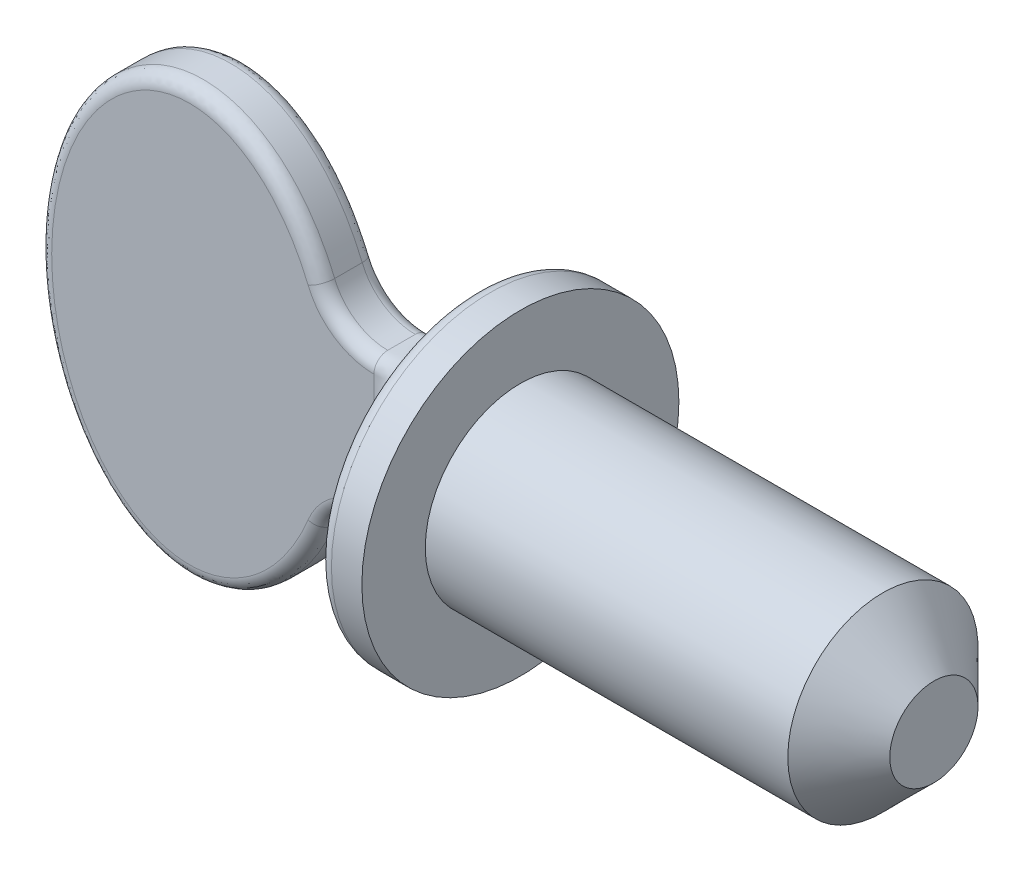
ISO-10303-21;
HEADER;
FILE_DESCRIPTION(('STEP AP214'),'2;1');
FILE_NAME('part.step','',(''),(''),'','','');
FILE_SCHEMA(('AUTOMOTIVE_DESIGN { 1 0 10303 214 1 1 1 1 }'));
ENDSEC;
DATA;
#1=APPLICATION_CONTEXT('core data for automotive mechanical design processes');
#2=APPLICATION_PROTOCOL_DEFINITION('international standard','automotive_design',2000,#1);
#3=PRODUCT_CONTEXT('',#1,'mechanical');
#4=PRODUCT('Part','Part','',(#3));
#5=PRODUCT_RELATED_PRODUCT_CATEGORY('part','',(#4));
#6=PRODUCT_DEFINITION_FORMATION('','',#4);
#7=PRODUCT_DEFINITION_CONTEXT('part definition',#1,'design');
#8=PRODUCT_DEFINITION('design','',#6,#7);
#9=PRODUCT_DEFINITION_SHAPE('','',#8);
#10=(LENGTH_UNIT() NAMED_UNIT(*) SI_UNIT(.MILLI.,.METRE.));
#11=(NAMED_UNIT(*) PLANE_ANGLE_UNIT() SI_UNIT($,.RADIAN.));
#12=(NAMED_UNIT(*) SI_UNIT($,.STERADIAN.) SOLID_ANGLE_UNIT());
#13=UNCERTAINTY_MEASURE_WITH_UNIT(LENGTH_MEASURE(1.E-05),#10,'distance_accuracy_value','');
#14=(GEOMETRIC_REPRESENTATION_CONTEXT(3) GLOBAL_UNCERTAINTY_ASSIGNED_CONTEXT((#13)) GLOBAL_UNIT_ASSIGNED_CONTEXT((#10,
#11,#12)) REPRESENTATION_CONTEXT('',''));
#15=CARTESIAN_POINT('',(0.,0.,0.));
#16=DIRECTION('',(0.,0.,1.));
#17=DIRECTION('',(1.,0.,0.));
#18=AXIS2_PLACEMENT_3D('',#15,#16,#17);
#19=CARTESIAN_POINT('',(3.39763741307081,-2.36920294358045,0.508));
#20=DIRECTION('',(0.,0.,-1.));
#21=DIRECTION('',(-1.,0.,0.));
#22=AXIS2_PLACEMENT_3D('',#19,#20,#21);
#23=CYLINDRICAL_SURFACE('',#22,1.05686961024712);
#24=DIRECTION('',(0.,0.,-1.));
#25=VECTOR('',#24,1.);
#26=CARTESIAN_POINT('',(2.41967497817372,-1.9685,0.508));
#27=LINE('',#26,#25);
#28=CARTESIAN_POINT('',(2.41967497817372,-1.9685,0.254));
#29=VERTEX_POINT('',#28);
#30=CARTESIAN_POINT('',(2.41967497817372,-1.9685,-0.254));
#31=VERTEX_POINT('',#30);
#32=EDGE_CURVE('E416',#29,#31,#27,.T.);
#33=ORIENTED_EDGE('',*,*,#32,.T.);
#34=CARTESIAN_POINT('',(3.39763741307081,-2.36920294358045,-0.254));
#35=DIRECTION('',(0.,0.,1.));
#36=DIRECTION('',(1.,0.,0.));
#37=AXIS2_PLACEMENT_3D('',#34,#35,#36);
#38=CIRCLE('',#37,1.05686961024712);
#39=CARTESIAN_POINT('',(3.39763741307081,-1.31233333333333,-0.254));
#40=VERTEX_POINT('',#39);
#41=EDGE_CURVE('E706',#31,#40,#38,.F.);
#42=ORIENTED_EDGE('',*,*,#41,.T.);
#43=DIRECTION('',(0.,0.,-1.));
#44=VECTOR('',#43,1.);
#45=CARTESIAN_POINT('',(3.39763741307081,-1.31233333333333,0.508));
#46=LINE('',#45,#44);
#47=CARTESIAN_POINT('',(3.39763741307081,-1.31233333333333,0.254));
#48=VERTEX_POINT('',#47);
#49=EDGE_CURVE('E349',#48,#40,#46,.T.);
#50=ORIENTED_EDGE('',*,*,#49,.F.);
#51=CARTESIAN_POINT('',(3.39763741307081,-2.36920294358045,0.254));
#52=DIRECTION('',(0.,0.,1.));
#53=DIRECTION('',(1.,0.,0.));
#54=AXIS2_PLACEMENT_3D('',#51,#52,#53);
#55=CIRCLE('',#54,1.05686961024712);
#56=EDGE_CURVE('E705',#48,#29,#55,.T.);
#57=ORIENTED_EDGE('',*,*,#56,.T.);
#58=EDGE_LOOP('',(#33,#42,#50,#57));
#59=FACE_BOUND('',#58,.T.);
#60=ADVANCED_FACE('F254',(#59),#23,.F.);
#61=CARTESIAN_POINT('',(3.39763741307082,2.36920294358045,0.508));
#62=DIRECTION('',(0.,0.,-1.));
#63=DIRECTION('',(-1.,0.,0.));
#64=AXIS2_PLACEMENT_3D('',#61,#62,#63);
#65=CYLINDRICAL_SURFACE('',#64,1.05686961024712);
#66=DIRECTION('',(0.,0.,-1.));
#67=VECTOR('',#66,1.);
#68=CARTESIAN_POINT('',(3.39763741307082,1.31233333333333,0.508));
#69=LINE('',#68,#67);
#70=CARTESIAN_POINT('',(3.39763741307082,1.31233333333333,0.254));
#71=VERTEX_POINT('',#70);
#72=CARTESIAN_POINT('',(3.39763741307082,1.31233333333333,-0.254));
#73=VERTEX_POINT('',#72);
#74=EDGE_CURVE('E598',#71,#73,#69,.T.);
#75=ORIENTED_EDGE('',*,*,#74,.T.);
#76=CARTESIAN_POINT('',(3.39763741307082,2.36920294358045,-0.254));
#77=DIRECTION('',(0.,0.,1.));
#78=DIRECTION('',(1.,0.,0.));
#79=AXIS2_PLACEMENT_3D('',#76,#77,#78);
#80=CIRCLE('',#79,1.05686961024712);
#81=CARTESIAN_POINT('',(2.41967497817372,1.9685,-0.254));
#82=VERTEX_POINT('',#81);
#83=EDGE_CURVE('E531',#73,#82,#80,.F.);
#84=ORIENTED_EDGE('',*,*,#83,.T.);
#85=DIRECTION('',(0.,0.,-1.));
#86=VECTOR('',#85,1.);
#87=CARTESIAN_POINT('',(2.41967497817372,1.9685,0.508));
#88=LINE('',#87,#86);
#89=CARTESIAN_POINT('',(2.41967497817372,1.9685,0.254));
#90=VERTEX_POINT('',#89);
#91=EDGE_CURVE('E596',#90,#82,#88,.T.);
#92=ORIENTED_EDGE('',*,*,#91,.F.);
#93=CARTESIAN_POINT('',(3.39763741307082,2.36920294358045,0.254));
#94=DIRECTION('',(0.,0.,1.));
#95=DIRECTION('',(1.,0.,0.));
#96=AXIS2_PLACEMENT_3D('',#93,#94,#95);
#97=CIRCLE('',#96,1.05686961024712);
#98=EDGE_CURVE('E524',#90,#71,#97,.T.);
#99=ORIENTED_EDGE('',*,*,#98,.T.);
#100=EDGE_LOOP('',(#75,#84,#92,#99));
#101=FACE_BOUND('',#100,.T.);
#102=ADVANCED_FACE('F423',(#101),#65,.F.);
#103=CARTESIAN_POINT('',(0.,0.,0.508));
#104=DIRECTION('',(0.,0.,1.));
#105=DIRECTION('',(0.,1.,0.));
#106=AXIS2_PLACEMENT_3D('',#103,#104,#105);
#107=ELLIPSE('',#106,3.937,2.794);
#108=DIRECTION('',(0.,0.,-1.));
#109=VECTOR('',#108,1.);
#110=SURFACE_OF_LINEAR_EXTRUSION('',#107,#109);
#111=ORIENTED_EDGE('',*,*,#91,.T.);
#112=CARTESIAN_POINT('',(-2.42953871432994,-1.06988650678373,-0.508));
#113=CARTESIAN_POINT('',(-2.67806308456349,-1.1223425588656,-0.508));
#114=CARTESIAN_POINT('',(-2.67806308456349,-1.1223425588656,-0.254));
#115=CARTESIAN_POINT('',(-2.38132756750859,-1.29830917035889,-0.508));
#116=CARTESIAN_POINT('',(-2.62738331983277,-1.36245895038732,-0.508));
#117=CARTESIAN_POINT('',(-2.62738331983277,-1.36245895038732,-0.254));
#118=CARTESIAN_POINT('',(-2.31706517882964,-1.52335296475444,-0.508));
#119=CARTESIAN_POINT('',(-2.55974244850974,-1.59951584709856,-0.508));
#120=CARTESIAN_POINT('',(-2.55974244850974,-1.59951584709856,-0.254));
#121=CARTESIAN_POINT('',(-2.15402597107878,-1.9606753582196,-0.508));
#122=CARTESIAN_POINT('',(-2.38735395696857,-2.06194694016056,-0.508));
#123=CARTESIAN_POINT('',(-2.38735395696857,-2.06194694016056,-0.254));
#124=CARTESIAN_POINT('',(-2.05530031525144,-2.17297233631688,-0.508));
#125=CARTESIAN_POINT('',(-2.28266133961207,-2.28733788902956,-0.508));
#126=CARTESIAN_POINT('',(-2.28266133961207,-2.28733788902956,-0.254));
#127=CARTESIAN_POINT('',(-1.8565056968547,-2.51319514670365,-0.508));
#128=CARTESIAN_POINT('',(-2.0702557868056,-2.65084271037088,-0.508));
#129=CARTESIAN_POINT('',(-2.0702557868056,-2.65084271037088,-0.254));
#130=CARTESIAN_POINT('',(-1.76631603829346,-2.64689289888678,-0.508));
#131=CARTESIAN_POINT('',(-1.97351333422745,-2.79437306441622,-0.508));
#132=CARTESIAN_POINT('',(-1.97351333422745,-2.79437306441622,-0.254));
#133=CARTESIAN_POINT('',(-1.56670354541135,-2.89917346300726,-0.508));
#134=CARTESIAN_POINT('',(-1.75790917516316,-3.06687436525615,-0.508));
#135=CARTESIAN_POINT('',(-1.75790917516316,-3.06687436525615,-0.254));
#136=CARTESIAN_POINT('',(-1.45730856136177,-3.01777773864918,-0.508));
#137=CARTESIAN_POINT('',(-1.63907948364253,-3.19586595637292,-0.508));
#138=CARTESIAN_POINT('',(-1.63907948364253,-3.19586595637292,-0.254));
#139=CARTESIAN_POINT('',(-1.24726681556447,-3.20759724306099,-0.508));
#140=CARTESIAN_POINT('',(-1.40883959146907,-3.40393298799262,-0.508));
#141=CARTESIAN_POINT('',(-1.40883959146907,-3.40393298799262,-0.254));
#142=CARTESIAN_POINT('',(-1.1507555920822,-3.28336841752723,-0.508));
#143=CARTESIAN_POINT('',(-1.30241841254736,-3.487576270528,-0.508));
#144=CARTESIAN_POINT('',(-1.30241841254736,-3.487576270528,-0.254));
#145=CARTESIAN_POINT('',(-0.946803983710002,-3.41849479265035,-0.508));
#146=CARTESIAN_POINT('',(-1.07576597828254,-3.63774144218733,-0.508));
#147=CARTESIAN_POINT('',(-1.07576597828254,-3.63774144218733,-0.254));
#148=CARTESIAN_POINT('',(-0.839378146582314,-3.47787146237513,-0.508));
#149=CARTESIAN_POINT('',(-0.955553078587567,-3.70428571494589,-0.508));
#150=CARTESIAN_POINT('',(-0.955553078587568,-3.70428571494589,-0.254));
#151=CARTESIAN_POINT('',(-0.633843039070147,-3.56789218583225,-0.508));
#152=CARTESIAN_POINT('',(-0.723818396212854,-3.80577636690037,-0.508));
#153=CARTESIAN_POINT('',(-0.723818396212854,-3.80577636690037,-0.254));
#154=CARTESIAN_POINT('',(-0.537108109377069,-3.60165598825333,-0.508));
#155=CARTESIAN_POINT('',(-0.614119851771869,-3.84411987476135,-0.508));
#156=CARTESIAN_POINT('',(-0.614119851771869,-3.84411987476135,-0.254));
#157=CARTESIAN_POINT('',(-0.339331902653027,-3.65248383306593,-0.508));
#158=CARTESIAN_POINT('',(-0.388801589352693,-3.90202243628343,-0.508));
#159=CARTESIAN_POINT('',(-0.388801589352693,-3.90202243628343,-0.254));
#160=CARTESIAN_POINT('',(-0.238293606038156,-3.66955924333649,-0.508));
#161=CARTESIAN_POINT('',(-0.273185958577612,-3.92159427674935,-0.508));
#162=CARTESIAN_POINT('',(-0.273185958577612,-3.92159427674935,-0.254));
#163=CARTESIAN_POINT('',(-0.0344753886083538,-3.68567445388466,-0.508));
#164=CARTESIAN_POINT('',(-0.0395873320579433,-3.94006182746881,-0.508));
#165=CARTESIAN_POINT('',(-0.0395873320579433,-3.94006182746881,-0.254));
#166=CARTESIAN_POINT('',(0.0683086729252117,-3.68466274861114,-0.508));
#167=CARTESIAN_POINT('',(0.0784014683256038,-3.93889849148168,-0.508));
#168=CARTESIAN_POINT('',(0.0784014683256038,-3.93889849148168,-0.254));
#169=CARTESIAN_POINT('',(0.272088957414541,-3.66456417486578,-0.508));
#170=CARTESIAN_POINT('',(0.311869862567,-3.91587428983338,-0.508));
#171=CARTESIAN_POINT('',(0.311869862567,-3.91587428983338,-0.254));
#172=CARTESIAN_POINT('',(0.373084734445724,-3.64547286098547,-0.508));
#173=CARTESIAN_POINT('',(0.427348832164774,-3.89400833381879,-0.508));
#174=CARTESIAN_POINT('',(0.427348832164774,-3.89400833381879,-0.254));
#175=CARTESIAN_POINT('',(0.566584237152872,-3.5918099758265,-0.508));
#176=CARTESIAN_POINT('',(0.647572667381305,-3.83293861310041,-0.508));
#177=CARTESIAN_POINT('',(0.647572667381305,-3.83293861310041,-0.254));
#178=CARTESIAN_POINT('',(0.659265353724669,-3.5578663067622,-0.508));
#179=CARTESIAN_POINT('',(0.75256001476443,-3.79443882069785,-0.508));
#180=CARTESIAN_POINT('',(0.75256001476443,-3.79443882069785,-0.254));
#181=CARTESIAN_POINT('',(0.838615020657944,-3.47679355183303,-0.508));
#182=CARTESIAN_POINT('',(0.954592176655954,-3.70311336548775,-0.508));
#183=CARTESIAN_POINT('',(0.954592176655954,-3.70311336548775,-0.254));
#184=CARTESIAN_POINT('',(0.925281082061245,-3.42965904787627,-0.508));
#185=CARTESIAN_POINT('',(1.05163370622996,-3.65028181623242,-0.508));
#186=CARTESIAN_POINT('',(1.05163370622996,-3.65028181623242,-0.254));
#187=CARTESIAN_POINT('',(1.12953179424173,-3.30045366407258,-0.508));
#188=CARTESIAN_POINT('',(1.27904250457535,-3.50643406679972,-0.508));
#189=CARTESIAN_POINT('',(1.27904250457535,-3.50643406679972,-0.254));
#190=CARTESIAN_POINT('',(1.24323792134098,-3.21224549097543,-0.508));
#191=CARTESIAN_POINT('',(1.40447787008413,-3.40898221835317,-0.508));
#192=CARTESIAN_POINT('',(1.40447787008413,-3.40898221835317,-0.254));
#193=CARTESIAN_POINT('',(1.45504675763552,-3.01870052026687,-0.508));
#194=CARTESIAN_POINT('',(1.63653892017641,-3.19692872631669,-0.508));
#195=CARTESIAN_POINT('',(1.63653892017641,-3.19692872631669,-0.254));
#196=CARTESIAN_POINT('',(1.55311138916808,-2.91332314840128,-0.508));
#197=CARTESIAN_POINT('',(1.74311876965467,-3.08228651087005,-0.508));
#198=CARTESIAN_POINT('',(1.74311876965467,-3.08228651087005,-0.254));
#199=CARTESIAN_POINT('',(1.75678198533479,-2.66196868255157,-0.508));
#200=CARTESIAN_POINT('',(1.9633248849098,-2.81052824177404,-0.508));
#201=CARTESIAN_POINT('',(1.9633248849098,-2.81052824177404,-0.254));
#202=CARTESIAN_POINT('',(1.85800944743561,-2.51246781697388,-0.508));
#203=CARTESIAN_POINT('',(2.07190130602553,-2.65000792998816,-0.508));
#204=CARTESIAN_POINT('',(2.07190130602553,-2.65000792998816,-0.254));
#205=CARTESIAN_POINT('',(2.03785333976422,-2.20076254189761,-0.508));
#206=CARTESIAN_POINT('',(2.26397611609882,-2.31709468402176,-0.508));
#207=CARTESIAN_POINT('',(2.26397611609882,-2.31709468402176,-0.254));
#208=CARTESIAN_POINT('',(2.11647846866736,-2.03856305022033,-0.508));
#209=CARTESIAN_POINT('',(2.34748415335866,-2.14470634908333,-0.508));
#210=CARTESIAN_POINT('',(2.34748415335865,-2.14470634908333,-0.254));
#211=CARTESIAN_POINT('',(2.22461915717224,-1.7746150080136,-0.508));
#212=CARTESIAN_POINT('',(2.46201925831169,-1.8651443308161,-0.508));
#213=CARTESIAN_POINT('',(2.46201925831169,-1.8651443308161,-0.254));
#214=CARTESIAN_POINT('',(2.2609989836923,-1.67559877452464,-0.508));
#215=CARTESIAN_POINT('',(2.5004698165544,-1.76047506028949,-0.508));
#216=CARTESIAN_POINT('',(2.5004698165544,-1.76047506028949,-0.254));
#217=CARTESIAN_POINT('',(2.32683156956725,-1.47533598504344,-0.508));
#218=CARTESIAN_POINT('',(2.56995291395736,-1.54910644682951,-0.508));
#219=CARTESIAN_POINT('',(2.56995291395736,-1.54910644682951,-0.254));
#220=CARTESIAN_POINT('',(2.35628633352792,-1.37409008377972,-0.508));
#221=CARTESIAN_POINT('',(2.60098759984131,-1.44240770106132,-0.508));
#222=CARTESIAN_POINT('',(2.60098759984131,-1.44240770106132,-0.254));
#223=CARTESIAN_POINT('',(2.45282237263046,-0.99672785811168,-0.508));
#224=CARTESIAN_POINT('',(2.70261039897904,-1.04518135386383,-0.508));
#225=CARTESIAN_POINT('',(2.70261039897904,-1.04518135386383,-0.254));
#226=CARTESIAN_POINT('',(2.49907252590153,-0.715044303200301,-0.508));
#227=CARTESIAN_POINT('',(2.7510952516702,-0.74956565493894,-0.508));
#228=CARTESIAN_POINT('',(2.7510952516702,-0.74956565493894,-0.254));
#229=CARTESIAN_POINT('',(2.54567248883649,-0.147495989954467,-0.508));
#230=CARTESIAN_POINT('',(2.79994937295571,-0.154504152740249,-0.508));
#231=CARTESIAN_POINT('',(2.79994937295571,-0.154504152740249,-0.254));
#232=CARTESIAN_POINT('',(2.54590842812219,0.138377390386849,-0.508));
#233=CARTESIAN_POINT('',(2.80019927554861,0.144949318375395,-0.508));
#234=CARTESIAN_POINT('',(2.80019927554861,0.144949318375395,-0.254));
#235=CARTESIAN_POINT('',(2.50314262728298,0.670744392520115,-0.508));
#236=CARTESIAN_POINT('',(2.75536014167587,0.703113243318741,-0.508));
#237=CARTESIAN_POINT('',(2.75536014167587,0.703113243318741,-0.254));
#238=CARTESIAN_POINT('',(2.46556625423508,0.917675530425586,-0.508));
#239=CARTESIAN_POINT('',(2.71596009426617,0.962218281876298,-0.508));
#240=CARTESIAN_POINT('',(2.71596009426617,0.962218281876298,-0.254));
#241=CARTESIAN_POINT('',(2.35351407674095,1.40317160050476,-0.508));
#242=CARTESIAN_POINT('',(2.5981091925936,1.47286514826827,-0.508));
#243=CARTESIAN_POINT('',(2.5981091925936,1.47286514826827,-0.254));
#244=CARTESIAN_POINT('',(2.27905720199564,1.64174075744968,-0.508));
#245=CARTESIAN_POINT('',(2.51967837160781,1.72441078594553,-0.508));
#246=CARTESIAN_POINT('',(2.51967837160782,1.72441078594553,-0.254));
#247=CARTESIAN_POINT('',(2.10296943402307,2.07153806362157,-0.508));
#248=CARTESIAN_POINT('',(2.33317448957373,2.17963119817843,-0.508));
#249=CARTESIAN_POINT('',(2.33317448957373,2.17963119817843,-0.254));
#250=CARTESIAN_POINT('',(2.00636516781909,2.26480890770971,-0.508));
#251=CARTESIAN_POINT('',(2.23053377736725,2.38518362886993,-0.508));
#252=CARTESIAN_POINT('',(2.23053377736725,2.38518362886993,-0.254));
#253=CARTESIAN_POINT('',(1.78047465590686,2.63124667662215,-0.508));
#254=CARTESIAN_POINT('',(1.98878457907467,2.77737954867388,-0.508));
#255=CARTESIAN_POINT('',(1.98878457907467,2.77737954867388,-0.254));
#256=CARTESIAN_POINT('',(1.65129083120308,2.80447416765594,-0.508));
#257=CARTESIAN_POINT('',(1.84979032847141,2.96407977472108,-0.508));
#258=CARTESIAN_POINT('',(1.84979032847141,2.96407977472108,-0.254));
#259=CARTESIAN_POINT('',(1.41779860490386,3.05444647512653,-0.508));
#260=CARTESIAN_POINT('',(1.59578914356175,3.23598875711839,-0.508));
#261=CARTESIAN_POINT('',(1.59578914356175,3.23598875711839,-0.254));
#262=CARTESIAN_POINT('',(1.32477852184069,3.14175732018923,-0.508));
#263=CARTESIAN_POINT('',(1.49405856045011,3.33156937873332,-0.508));
#264=CARTESIAN_POINT('',(1.49405856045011,3.33156937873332,-0.254));
#265=CARTESIAN_POINT('',(1.1264653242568,3.3011914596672,-0.508));
#266=CARTESIAN_POINT('',(1.27551873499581,3.50726804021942,-0.508));
#267=CARTESIAN_POINT('',(1.27551873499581,3.50726804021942,-0.254));
#268=CARTESIAN_POINT('',(1.02118853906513,3.37333460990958,-0.508));
#269=CARTESIAN_POINT('',(1.15872953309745,3.58740628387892,-0.508));
#270=CARTESIAN_POINT('',(1.15872953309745,3.58740628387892,-0.254));
#271=CARTESIAN_POINT('',(0.817330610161,3.48785914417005,-0.508));
#272=CARTESIAN_POINT('',(0.930720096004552,3.7154934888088,-0.508));
#273=CARTESIAN_POINT('',(0.930720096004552,3.7154934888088,-0.254));
#274=CARTESIAN_POINT('',(0.720402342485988,3.53316262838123,-0.508));
#275=CARTESIAN_POINT('',(0.821632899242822,3.76654812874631,-0.508));
#276=CARTESIAN_POINT('',(0.821632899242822,3.76654812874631,-0.254));
#277=CARTESIAN_POINT('',(0.520328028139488,3.60703504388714,-0.508));
#278=CARTESIAN_POINT('',(0.595089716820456,3.85018992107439,-0.508));
#279=CARTESIAN_POINT('',(0.595089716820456,3.85018992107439,-0.254));
#280=CARTESIAN_POINT('',(0.417186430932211,3.63561579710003,-0.508));
#281=CARTESIAN_POINT('',(0.477639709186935,3.88279011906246,-0.508));
#282=CARTESIAN_POINT('',(0.477639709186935,3.88279011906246,-0.254));
#283=CARTESIAN_POINT('',(0.206818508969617,3.67387815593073,-0.508));
#284=CARTESIAN_POINT('',(0.237206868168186,3.92651558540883,-0.508));
#285=CARTESIAN_POINT('',(0.237206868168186,3.92651558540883,-0.254));
#286=CARTESIAN_POINT('',(0.0995732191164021,3.68345742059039,-0.508));
#287=CARTESIAN_POINT('',(0.114197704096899,3.9375245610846,-0.508));
#288=CARTESIAN_POINT('',(0.114197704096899,3.9375245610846,-0.254));
#289=CARTESIAN_POINT('',(-0.114821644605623,3.68250895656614,-0.508));
#290=CARTESIAN_POINT('',(-0.131686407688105,3.93643687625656,-0.508));
#291=CARTESIAN_POINT('',(-0.131686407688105,3.93643687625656,-0.254));
#292=CARTESIAN_POINT('',(-0.221971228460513,3.67198365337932,-0.508));
#293=CARTESIAN_POINT('',(-0.254561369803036,3.92434300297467,-0.508));
#294=CARTESIAN_POINT('',(-0.254561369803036,3.92434300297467,-0.254));
#295=CARTESIAN_POINT('',(-0.423404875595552,3.6335702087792,-0.508));
#296=CARTESIAN_POINT('',(-0.484708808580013,3.88045959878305,-0.508));
#297=CARTESIAN_POINT('',(-0.484708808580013,3.88045959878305,-0.254));
#298=CARTESIAN_POINT('',(-0.517999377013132,3.60726509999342,-0.508));
#299=CARTESIAN_POINT('',(-0.592410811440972,3.85046695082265,-0.508));
#300=CARTESIAN_POINT('',(-0.592410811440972,3.85046695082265,-0.254));
#301=CARTESIAN_POINT('',(-0.702018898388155,3.54051420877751,-0.508));
#302=CARTESIAN_POINT('',(-0.80085538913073,3.77485728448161,-0.508));
#303=CARTESIAN_POINT('',(-0.800855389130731,3.77485728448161,-0.254));
#304=CARTESIAN_POINT('',(-0.791441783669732,3.5000626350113,-0.508));
#305=CARTESIAN_POINT('',(-0.901595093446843,3.72923386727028,-0.508));
#306=CARTESIAN_POINT('',(-0.901595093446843,3.72923386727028,-0.254));
#307=CARTESIAN_POINT('',(-0.995772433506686,3.38993421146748,-0.508));
#308=CARTESIAN_POINT('',(-1.13047031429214,3.60588286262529,-0.508));
#309=CARTESIAN_POINT('',(-1.13047031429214,3.60588286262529,-0.254));
#310=CARTESIAN_POINT('',(-1.10783636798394,3.31498239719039,-0.508));
#311=CARTESIAN_POINT('',(-1.25491481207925,3.52252387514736,-0.508));
#312=CARTESIAN_POINT('',(-1.25491481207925,3.52252387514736,-0.254));
#313=CARTESIAN_POINT('',(-1.31837395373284,3.14796333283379,-0.508));
#314=CARTESIAN_POINT('',(-1.48706802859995,3.33835616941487,-0.508));
#315=CARTESIAN_POINT('',(-1.48706802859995,3.33835616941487,-0.254));
#316=CARTESIAN_POINT('',(-1.41681992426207,3.05586208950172,-0.508));
#317=CARTESIAN_POINT('',(-1.59474271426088,3.23751282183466,-0.508));
#318=CARTESIAN_POINT('',(-1.59474271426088,3.23751282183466,-0.254));
#319=CARTESIAN_POINT('',(-1.63609804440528,2.82020806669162,-0.508));
#320=CARTESIAN_POINT('',(-1.83323646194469,2.98121697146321,-0.508));
#321=CARTESIAN_POINT('',(-1.83323646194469,2.98121697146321,-0.254));
#322=CARTESIAN_POINT('',(-1.75048386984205,2.67067473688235,-0.508));
#323=CARTESIAN_POINT('',(-1.95647717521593,2.81989583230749,-0.508));
#324=CARTESIAN_POINT('',(-1.95647717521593,2.81989583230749,-0.254));
#325=CARTESIAN_POINT('',(-1.95420988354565,2.35553788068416,-0.508));
#326=CARTESIAN_POINT('',(-2.1748556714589,2.48207587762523,-0.508));
#327=CARTESIAN_POINT('',(-2.1748556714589,2.48207587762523,-0.254));
#328=CARTESIAN_POINT('',(-2.04350621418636,2.18990688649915,-0.508));
#329=CARTESIAN_POINT('',(-2.2699442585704,2.30555118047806,-0.508));
#330=CARTESIAN_POINT('',(-2.2699442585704,2.30555118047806,-0.254));
#331=CARTESIAN_POINT('',(-2.22882804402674,1.78241164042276,-0.508));
#332=CARTESIAN_POINT('',(-2.46665332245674,1.87302961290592,-0.508));
#333=CARTESIAN_POINT('',(-2.46665332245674,1.87302961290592,-0.254));
#334=CARTESIAN_POINT('',(-2.3142397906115,1.53572223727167,-0.508));
#335=CARTESIAN_POINT('',(-2.55672789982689,1.61257271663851,-0.508));
#336=CARTESIAN_POINT('',(-2.55672789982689,1.61257271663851,-0.254));
#337=CARTESIAN_POINT('',(-2.44446639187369,1.03199799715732,-0.508));
#338=CARTESIAN_POINT('',(-2.69381177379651,1.08228449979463,-0.508));
#339=CARTESIAN_POINT('',(-2.69381177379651,1.08228449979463,-0.254));
#340=CARTESIAN_POINT('',(-2.48924065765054,0.774953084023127,-0.508));
#341=CARTESIAN_POINT('',(-2.74077801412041,0.812444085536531,-0.508));
#342=CARTESIAN_POINT('',(-2.74077801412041,0.812444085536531,-0.254));
#343=CARTESIAN_POINT('',(-2.54075598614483,0.251563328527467,-0.508));
#344=CARTESIAN_POINT('',(-2.79480168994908,0.263568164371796,-0.508));
#345=CARTESIAN_POINT('',(-2.79480168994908,0.263568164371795,-0.254));
#346=CARTESIAN_POINT('',(-2.54666205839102,-0.0148627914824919,-0.508));
#347=CARTESIAN_POINT('',(-2.80098296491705,-0.015540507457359,-0.508));
#348=CARTESIAN_POINT('',(-2.80098296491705,-0.0155405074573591,-0.254));
#349=CARTESIAN_POINT('',(-2.51848120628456,-0.545613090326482,-0.508));
#350=CARTESIAN_POINT('',(-2.77144588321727,-0.571867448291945,-0.508));
#351=CARTESIAN_POINT('',(-2.77144588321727,-0.571867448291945,-0.254));
#352=CARTESIAN_POINT('',(-2.48440379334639,-0.809937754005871,-0.508));
#353=CARTESIAN_POINT('',(-2.73573749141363,-0.849086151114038,-0.508));
#354=CARTESIAN_POINT('',(-2.73573749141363,-0.849086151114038,-0.254));
#355=CARTESIAN_POINT('',(-2.42953871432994,-1.06988650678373,-0.508));
#356=CARTESIAN_POINT('',(-2.67806308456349,-1.1223425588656,-0.508));
#357=CARTESIAN_POINT('',(-2.67806308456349,-1.1223425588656,-0.254));
#358=(BOUNDED_SURFACE() B_SPLINE_SURFACE(3,2,((#112,#113,#114),(#115,#116,#117),(#118,#119,
#120),(#121,#122,#123),(#124,#125,#126),(#127,#128,#129),(#130,#131,#132),(#133,#134,#135),
(#136,#137,#138),(#139,#140,#141),(#142,#143,#144),(#145,#146,#147),(#148,#149,#150),(#151,#152,
#153),(#154,#155,#156),(#157,#158,#159),(#160,#161,#162),(#163,#164,#165),(#166,#167,#168),
(#169,#170,#171),(#172,#173,#174),(#175,#176,#177),(#178,#179,#180),(#181,#182,#183),(#184,#185,
#186),(#187,#188,#189),(#190,#191,#192),(#193,#194,#195),(#196,#197,#198),(#199,#200,#201),
(#202,#203,#204),(#205,#206,#207),(#208,#209,#210),(#211,#212,#213),(#214,#215,#216),(#217,#218,
#219),(#220,#221,#222),(#223,#224,#225),(#226,#227,#228),(#229,#230,#231),(#232,#233,#234),
(#235,#236,#237),(#238,#239,#240),(#241,#242,#243),(#244,#245,#246),(#247,#248,#249),(#250,#251,
#252),(#253,#254,#255),(#256,#257,#258),(#259,#260,#261),(#262,#263,#264),(#265,#266,#267),
(#268,#269,#270),(#271,#272,#273),(#274,#275,#276),(#277,#278,#279),(#280,#281,#282),(#283,#284,
#285),(#286,#287,#288),(#289,#290,#291),(#292,#293,#294),(#295,#296,#297),(#298,#299,#300),
(#301,#302,#303),(#304,#305,#306),(#307,#308,#309),(#310,#311,#312),(#313,#314,#315),(#316,#317,
#318),(#319,#320,#321),(#322,#323,#324),(#325,#326,#327),(#328,#329,#330),(#331,#332,#333),
(#334,#335,#336),(#337,#338,#339),(#340,#341,#342),(#343,#344,#345),(#346,#347,#348),(#349,#350,
#351),(#352,#353,#354),(#355,#356,#357)),.UNSPECIFIED.,.T.,.F.,
.F.) B_SPLINE_SURFACE_WITH_KNOTS((4,2,2,2,2,2,2,2,2,2,2,2,2,2,2,2,2,2,2,2,2,2,2,2,2,2,2,2,2,2,2,
2,2,2,2,2,2,2,2,2,4),(3,3),(0.,0.699735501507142,1.39843658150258,1.88081590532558,
2.36250140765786,2.7293120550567,3.09564005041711,3.401707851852,3.7075670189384,
4.01429730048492,4.32110302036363,4.61603131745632,4.91108093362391,5.34040544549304,
5.77075965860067,6.31008999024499,6.84921247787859,7.16544039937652,7.48157666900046,
8.33348152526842,9.18749454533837,9.93427445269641,10.6806714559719,11.3262865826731,
11.9698968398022,12.3514499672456,12.7325004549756,13.052173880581,13.371621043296,
13.6927841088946,14.0139084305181,14.3072154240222,14.6006426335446,15.0028628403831,
15.405888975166,15.9675913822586,16.530269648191,17.3092934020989,18.0890943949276,
18.8855943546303,19.6819048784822),(0.,1.),
.UNSPECIFIED.) GEOMETRIC_REPRESENTATION_ITEM() RATIONAL_B_SPLINE_SURFACE(((1.,0.707106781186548,
1.),(1.,0.707106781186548,1.),(1.,0.707106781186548,1.),(1.,0.707106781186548,1.),(1.,
0.707106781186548,1.),(1.,0.707106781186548,1.),(1.,0.707106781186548,1.),(1.,0.707106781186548,
1.),(1.,0.707106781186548,1.),(1.,0.707106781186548,1.),(1.,0.707106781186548,1.),(1.,
0.707106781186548,1.),(1.,0.707106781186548,1.),(1.,0.707106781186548,1.),(1.,0.707106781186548,
1.),(1.,0.707106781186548,1.),(1.,0.707106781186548,1.),(1.,0.707106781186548,1.),(1.,
0.707106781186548,1.),(1.,0.707106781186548,1.),(1.,0.707106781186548,1.),(1.,0.707106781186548,
1.),(1.,0.707106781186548,1.),(1.,0.707106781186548,1.),(1.,0.707106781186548,1.),(1.,
0.707106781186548,1.),(1.,0.707106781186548,1.),(1.,0.707106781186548,1.),(1.,0.707106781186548,
1.),(1.,0.707106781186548,1.),(1.,0.707106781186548,1.),(1.,0.707106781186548,1.),(1.,
0.707106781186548,1.),(1.,0.707106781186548,1.),(1.,0.707106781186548,1.),(1.,0.707106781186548,
1.),(1.,0.707106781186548,1.),(1.,0.707106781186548,1.),(1.,0.707106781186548,1.),(1.,
0.707106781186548,1.),(1.,0.707106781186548,1.),(1.,0.707106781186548,1.),(1.,0.707106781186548,
1.),(1.,0.707106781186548,1.),(1.,0.707106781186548,1.),(1.,0.707106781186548,1.),(1.,
0.707106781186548,1.),(1.,0.707106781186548,1.),(1.,0.707106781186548,1.),(1.,0.707106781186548,
1.),(1.,0.707106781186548,1.),(1.,0.707106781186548,1.),(1.,0.707106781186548,1.),(1.,
0.707106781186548,1.),(1.,0.707106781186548,1.),(1.,0.707106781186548,1.),(1.,0.707106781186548,
1.),(1.,0.707106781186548,1.),(1.,0.707106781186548,1.),(1.,0.707106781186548,1.),(1.,
0.707106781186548,1.),(1.,0.707106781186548,1.),(1.,0.707106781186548,1.),(1.,0.707106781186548,
1.),(1.,0.707106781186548,1.),(1.,0.707106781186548,1.),(1.,0.707106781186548,1.),(1.,
0.707106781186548,1.),(1.,0.707106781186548,1.),(1.,0.707106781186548,1.),(1.,0.707106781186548,
1.),(1.,0.707106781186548,1.),(1.,0.707106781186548,1.),(1.,0.707106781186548,1.),(1.,
0.707106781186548,1.),(1.,0.707106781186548,1.),(1.,0.707106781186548,1.),(1.,0.707106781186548,
1.),(1.,0.707106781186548,1.),(1.,0.707106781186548,1.),(1.,0.707106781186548,1.),(1.,
0.707106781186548,1.))) REPRESENTATION_ITEM('') SURFACE());
#359=CARTESIAN_POINT('',(2.41967497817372,1.9685,-0.254));
#360=CARTESIAN_POINT('',(2.25031042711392,2.38542945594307,-0.254));
#361=CARTESIAN_POINT('',(2.00596675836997,2.79648158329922,-0.254));
#362=CARTESIAN_POINT('',(1.49799160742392,3.34093166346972,-0.254));
#363=CARTESIAN_POINT('',(1.27918524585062,3.52006526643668,-0.254));
#364=CARTESIAN_POINT('',(0.824519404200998,3.77487228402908,-0.254));
#365=CARTESIAN_POINT('',(0.5953372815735,3.86152000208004,-0.254));
#366=CARTESIAN_POINT('',(0.11627433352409,3.94837182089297,-0.254));
#367=CARTESIAN_POINT('',(-0.133883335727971,3.94714153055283,-0.254));
#368=CARTESIAN_POINT('',(-0.592713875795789,3.86005719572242,-0.254));
#369=CARTESIAN_POINT('',(-0.803064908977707,3.78232434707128,-0.254));
#370=CARTESIAN_POINT('',(-1.25884339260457,3.53671269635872,-0.254));
#371=CARTESIAN_POINT('',(-1.49225794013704,3.34730250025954,-0.254));
#372=CARTESIAN_POINT('',(-1.9688886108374,2.83590773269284,-0.254));
#373=CARTESIAN_POINT('',(-2.18567037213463,2.49073765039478,-0.254));
#374=CARTESIAN_POINT('',(-2.57946081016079,1.62514496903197,-0.254));
#375=CARTESIAN_POINT('',(-2.71380281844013,1.08646076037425,-0.254));
#376=CARTESIAN_POINT('',(-2.82215303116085,-0.0142692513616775,-0.254));
#377=CARTESIAN_POINT('',(-2.79328752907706,-0.576559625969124,-0.254));
#378=CARTESIAN_POINT('',(-2.5760189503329,-1.60569439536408,-0.254));
#379=CARTESIAN_POINT('',(-2.40624277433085,-2.07609930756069,-0.254));
#380=CARTESIAN_POINT('',(-1.98146625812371,-2.80261486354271,-0.254));
#381=CARTESIAN_POINT('',(-1.76650882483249,-3.08096180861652,-0.254));
#382=CARTESIAN_POINT('',(-1.30657381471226,-3.49615219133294,-0.254));
#383=CARTESIAN_POINT('',(-1.07838575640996,-3.65062001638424,-0.254));
#384=CARTESIAN_POINT('',(-0.616409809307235,-3.85270583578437,-0.254));
#385=CARTESIAN_POINT('',(-0.388253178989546,-3.91258803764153,-0.254));
#386=CARTESIAN_POINT('',(0.0769150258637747,-3.94918083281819,-0.254));
#387=CARTESIAN_POINT('',(0.313980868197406,-3.92525354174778,-0.254));
#388=CARTESIAN_POINT('',(0.753403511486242,-3.80377336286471,-0.254));
#389=CARTESIAN_POINT('',(0.956930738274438,-3.71016433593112,-0.254));
#390=CARTESIAN_POINT('',(1.40977740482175,-3.42376866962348,-0.254));
#391=CARTESIAN_POINT('',(1.6427552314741,-3.20589476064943,-0.254));
#392=CARTESIAN_POINT('',(2.03111441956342,-2.72710992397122,-0.254));
#393=CARTESIAN_POINT('',(2.18919790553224,-2.46823947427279,-0.254));
#394=CARTESIAN_POINT('',(2.35453247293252,-2.12142025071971,-0.254));
#395=CARTESIAN_POINT('',(2.38815642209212,-2.04532960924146,-0.254));
#396=CARTESIAN_POINT('',(2.41967497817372,-1.9685,-0.254));
#397=B_SPLINE_CURVE_WITH_KNOTS('',3,(#359,#360,#361,#362,#363,#364,#365,#366,#367,#368,#369,
#370,#371,#372,#373,#374,#375,#376,#377,#378,#379,#380,#381,#382,#383,#384,#385,#386,#387,#388,
#389,#390,#391,#392,#393,#394,#395,#396),.UNSPECIFIED.,.F.,.F.,(4,2,2,2,2,2,2,2,2,2,2,2,2,2,2,2,
2,2,4),(0.,1.37556453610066,2.21375379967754,2.93458248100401,3.66717955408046,4.32956836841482,
5.21483606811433,6.41718702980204,8.05393798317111,9.71959706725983,11.1947245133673,
12.2336794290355,13.0458946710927,13.740094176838,14.4395887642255,15.1022444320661,
16.0414723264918,16.9435917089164,17.1929672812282),.UNSPECIFIED.);
#398=EDGE_CURVE('E457',#82,#31,#397,.T.);
#399=ORIENTED_EDGE('',*,*,#398,.T.);
#400=ORIENTED_EDGE('',*,*,#32,.F.);
#401=CARTESIAN_POINT('',(-2.42953871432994,1.06988650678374,0.508));
#402=CARTESIAN_POINT('',(-2.67806308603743,1.12234255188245,0.508));
#403=CARTESIAN_POINT('',(-2.67806308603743,1.12234255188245,0.254));
#404=CARTESIAN_POINT('',(-2.38132756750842,1.29830917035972,0.508));
#405=CARTESIAN_POINT('',(-2.62738332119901,1.36245894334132,0.508));
#406=CARTESIAN_POINT('',(-2.62738332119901,1.36245894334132,0.254));
#407=CARTESIAN_POINT('',(-2.31706517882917,1.52335296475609,0.508));
#408=CARTESIAN_POINT('',(-2.55974244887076,1.59951584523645,0.508));
#409=CARTESIAN_POINT('',(-2.55974244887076,1.59951584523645,0.254));
#410=CARTESIAN_POINT('',(-2.15402597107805,1.96067535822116,0.508));
#411=CARTESIAN_POINT('',(-2.38735395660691,2.06194694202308,0.508));
#412=CARTESIAN_POINT('',(-2.38735395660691,2.06194694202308,0.254));
#413=CARTESIAN_POINT('',(-2.05530031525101,2.17297233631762,0.508));
#414=CARTESIAN_POINT('',(-2.28266133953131,2.28733788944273,0.508));
#415=CARTESIAN_POINT('',(-2.28266133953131,2.28733788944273,0.254));
#416=CARTESIAN_POINT('',(-1.8565056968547,2.51319514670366,0.508));
#417=CARTESIAN_POINT('',(-2.07025578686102,2.65084271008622,0.508));
#418=CARTESIAN_POINT('',(-2.07025578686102,2.65084271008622,0.254));
#419=CARTESIAN_POINT('',(-1.76631603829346,2.64689289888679,0.508));
#420=CARTESIAN_POINT('',(-1.97351333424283,2.79437306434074,0.508));
#421=CARTESIAN_POINT('',(-1.97351333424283,2.79437306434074,0.254));
#422=CARTESIAN_POINT('',(-1.56670354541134,2.89917346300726,0.508));
#423=CARTESIAN_POINT('',(-1.75790917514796,3.06687436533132,0.508));
#424=CARTESIAN_POINT('',(-1.75790917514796,3.06687436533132,0.254));
#425=CARTESIAN_POINT('',(-1.45730856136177,3.01777773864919,0.508));
#426=CARTESIAN_POINT('',(-1.63907948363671,3.19586595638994,0.508));
#427=CARTESIAN_POINT('',(-1.63907948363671,3.19586595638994,0.254));
#428=CARTESIAN_POINT('',(-1.24726681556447,3.20759724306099,0.508));
#429=CARTESIAN_POINT('',(-1.40883959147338,3.40393298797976,0.508));
#430=CARTESIAN_POINT('',(-1.40883959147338,3.40393298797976,0.254));
#431=CARTESIAN_POINT('',(-1.1507555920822,3.28336841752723,0.508));
#432=CARTESIAN_POINT('',(-1.30241841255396,3.4875762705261,0.508));
#433=CARTESIAN_POINT('',(-1.30241841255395,3.4875762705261,0.254));
#434=CARTESIAN_POINT('',(-0.946803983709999,3.41849479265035,0.508));
#435=CARTESIAN_POINT('',(-1.07576597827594,3.63774144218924,0.508));
#436=CARTESIAN_POINT('',(-1.07576597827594,3.63774144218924,0.254));
#437=CARTESIAN_POINT('',(-0.839378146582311,3.47787146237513,0.508));
#438=CARTESIAN_POINT('',(-0.955553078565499,3.70428571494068,0.508));
#439=CARTESIAN_POINT('',(-0.955553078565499,3.70428571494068,0.254));
#440=CARTESIAN_POINT('',(-0.633843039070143,3.56789218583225,0.508));
#441=CARTESIAN_POINT('',(-0.723818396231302,3.80577636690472,0.508));
#442=CARTESIAN_POINT('',(-0.723818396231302,3.80577636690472,0.254));
#443=CARTESIAN_POINT('',(-0.537108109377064,3.60165598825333,0.508));
#444=CARTESIAN_POINT('',(-0.614119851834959,3.84411987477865,0.508));
#445=CARTESIAN_POINT('',(-0.614119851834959,3.84411987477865,0.254));
#446=CARTESIAN_POINT('',(-0.339331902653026,3.65248383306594,0.508));
#447=CARTESIAN_POINT('',(-0.38880158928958,3.90202243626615,0.508));
#448=CARTESIAN_POINT('',(-0.38880158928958,3.90202243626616,0.254));
#449=CARTESIAN_POINT('',(-0.23829360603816,3.6695592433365,0.508));
#450=CARTESIAN_POINT('',(-0.2731859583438,3.92159427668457,0.508));
#451=CARTESIAN_POINT('',(-0.2731859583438,3.92159427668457,0.254));
#452=CARTESIAN_POINT('',(-0.0344753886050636,3.68567445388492,0.508));
#453=CARTESIAN_POINT('',(-0.0395873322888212,3.94006182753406,0.508));
#454=CARTESIAN_POINT('',(-0.0395873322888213,3.94006182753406,0.254));
#455=CARTESIAN_POINT('',(0.0683086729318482,3.68466274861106,0.508));
#456=CARTESIAN_POINT('',(0.0784014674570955,3.93889849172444,0.508));
#457=CARTESIAN_POINT('',(0.0784014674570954,3.93889849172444,0.254));
#458=CARTESIAN_POINT('',(0.272088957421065,3.66456417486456,0.508));
#459=CARTESIAN_POINT('',(0.311869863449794,3.91587428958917,0.508));
#460=CARTESIAN_POINT('',(0.311869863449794,3.91587428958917,0.254));
#461=CARTESIAN_POINT('',(0.373084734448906,3.64547286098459,0.508));
#462=CARTESIAN_POINT('',(0.427348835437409,3.89400833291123,0.508));
#463=CARTESIAN_POINT('',(0.427348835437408,3.89400833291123,0.254));
#464=CARTESIAN_POINT('',(0.566584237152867,3.5918099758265,0.508));
#465=CARTESIAN_POINT('',(0.647572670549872,3.83293861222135,0.508));
#466=CARTESIAN_POINT('',(0.647572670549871,3.83293861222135,0.254));
#467=CARTESIAN_POINT('',(0.659265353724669,3.5578663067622,0.508));
#468=CARTESIAN_POINT('',(0.752560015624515,3.79443882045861,0.508));
#469=CARTESIAN_POINT('',(0.752560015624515,3.79443882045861,0.254));
#470=CARTESIAN_POINT('',(0.838615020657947,3.47679355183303,0.508));
#471=CARTESIAN_POINT('',(0.954592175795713,3.703113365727,0.508));
#472=CARTESIAN_POINT('',(0.954592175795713,3.703113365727,0.254));
#473=CARTESIAN_POINT('',(0.925281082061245,3.42965904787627,0.508));
#474=CARTESIAN_POINT('',(1.05163370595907,3.65028181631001,0.508));
#475=CARTESIAN_POINT('',(1.05163370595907,3.65028181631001,0.254));
#476=CARTESIAN_POINT('',(1.12953179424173,3.30045366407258,0.508));
#477=CARTESIAN_POINT('',(1.27904250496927,3.50643406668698,0.508));
#478=CARTESIAN_POINT('',(1.27904250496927,3.50643406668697,0.254));
#479=CARTESIAN_POINT('',(1.24323792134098,3.21224549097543,0.508));
#480=CARTESIAN_POINT('',(1.4044778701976,3.40898221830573,0.508));
#481=CARTESIAN_POINT('',(1.4044778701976,3.40898221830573,0.254));
#482=CARTESIAN_POINT('',(1.45504675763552,3.01870052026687,0.508));
#483=CARTESIAN_POINT('',(1.63653892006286,3.19692872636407,0.508));
#484=CARTESIAN_POINT('',(1.63653892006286,3.19692872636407,0.254));
#485=CARTESIAN_POINT('',(1.55311138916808,2.91332314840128,0.508));
#486=CARTESIAN_POINT('',(1.74311876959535,3.08228651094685,0.508));
#487=CARTESIAN_POINT('',(1.74311876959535,3.08228651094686,0.254));
#488=CARTESIAN_POINT('',(1.75678198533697,2.66196868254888,0.508));
#489=CARTESIAN_POINT('',(1.963324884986,2.81052824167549,0.508));
#490=CARTESIAN_POINT('',(1.963324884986,2.81052824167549,0.254));
#491=CARTESIAN_POINT('',(1.85800944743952,2.51246781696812,0.508));
#492=CARTESIAN_POINT('',(2.07190130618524,2.65000792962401,0.508));
#493=CARTESIAN_POINT('',(2.07190130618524,2.65000792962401,0.254));
#494=CARTESIAN_POINT('',(2.03785333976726,2.20076254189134,0.508));
#495=CARTESIAN_POINT('',(2.26397611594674,2.31709468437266,0.508));
#496=CARTESIAN_POINT('',(2.26397611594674,2.31709468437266,0.254));
#497=CARTESIAN_POINT('',(2.11647846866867,2.03856305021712,0.508));
#498=CARTESIAN_POINT('',(2.3474841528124,2.14470635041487,0.508));
#499=CARTESIAN_POINT('',(2.3474841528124,2.14470635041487,0.254));
#500=CARTESIAN_POINT('',(2.22461915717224,1.7746150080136,0.508));
#501=CARTESIAN_POINT('',(2.46201925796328,1.86514433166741,0.508));
#502=CARTESIAN_POINT('',(2.46201925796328,1.86514433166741,0.254));
#503=CARTESIAN_POINT('',(2.2609989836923,1.67559877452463,0.508));
#504=CARTESIAN_POINT('',(2.50046981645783,1.76047506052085,0.508));
#505=CARTESIAN_POINT('',(2.50046981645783,1.76047506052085,0.254));
#506=CARTESIAN_POINT('',(2.32683156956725,1.47533598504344,0.508));
#507=CARTESIAN_POINT('',(2.56995291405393,1.54910644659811,0.508));
#508=CARTESIAN_POINT('',(2.56995291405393,1.54910644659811,0.254));
#509=CARTESIAN_POINT('',(2.35628633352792,1.37409008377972,0.508));
#510=CARTESIAN_POINT('',(2.60098759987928,1.4424077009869,0.508));
#511=CARTESIAN_POINT('',(2.60098759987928,1.4424077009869,0.254));
#512=CARTESIAN_POINT('',(2.45282237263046,0.996727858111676,0.508));
#513=CARTESIAN_POINT('',(2.70261039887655,1.0451813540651,0.508));
#514=CARTESIAN_POINT('',(2.70261039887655,1.0451813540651,0.254));
#515=CARTESIAN_POINT('',(2.49907252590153,0.715044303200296,0.508));
#516=CARTESIAN_POINT('',(2.75109525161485,0.749565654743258,0.508));
#517=CARTESIAN_POINT('',(2.75109525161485,0.749565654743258,0.254));
#518=CARTESIAN_POINT('',(2.54567248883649,0.147495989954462,0.508));
#519=CARTESIAN_POINT('',(2.79994937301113,0.154504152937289,0.508));
#520=CARTESIAN_POINT('',(2.79994937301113,0.154504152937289,0.254));
#521=CARTESIAN_POINT('',(2.54590842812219,-0.138377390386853,0.508));
#522=CARTESIAN_POINT('',(2.80019927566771,-0.144949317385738,0.508));
#523=CARTESIAN_POINT('',(2.80019927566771,-0.144949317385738,0.254));
#524=CARTESIAN_POINT('',(2.50314262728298,-0.67074439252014,0.508));
#525=CARTESIAN_POINT('',(2.75536014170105,-0.703113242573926,0.508));
#526=CARTESIAN_POINT('',(2.75536014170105,-0.703113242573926,0.254));
#527=CARTESIAN_POINT('',(2.46556625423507,-0.917675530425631,0.508));
#528=CARTESIAN_POINT('',(2.71596009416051,-0.96221828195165,0.508));
#529=CARTESIAN_POINT('',(2.71596009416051,-0.96221828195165,0.254));
#530=CARTESIAN_POINT('',(2.35351407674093,-1.4031716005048,0.508));
#531=CARTESIAN_POINT('',(2.59810919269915,-1.47286514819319,0.508));
#532=CARTESIAN_POINT('',(2.59810919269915,-1.47286514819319,0.254));
#533=CARTESIAN_POINT('',(2.27905720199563,-1.6417407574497,0.508));
#534=CARTESIAN_POINT('',(2.51967837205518,-1.72441078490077,0.508));
#535=CARTESIAN_POINT('',(2.51967837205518,-1.72441078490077,0.254));
#536=CARTESIAN_POINT('',(2.10296943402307,-2.07153806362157,0.508));
#537=CARTESIAN_POINT('',(2.33317448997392,-2.17963119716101,0.508));
#538=CARTESIAN_POINT('',(2.33317448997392,-2.17963119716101,0.254));
#539=CARTESIAN_POINT('',(2.00636516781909,-2.26480890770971,0.508));
#540=CARTESIAN_POINT('',(2.2305337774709,-2.38518362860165,0.508));
#541=CARTESIAN_POINT('',(2.2305337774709,-2.38518362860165,0.254));
#542=CARTESIAN_POINT('',(1.78047465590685,-2.63124667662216,0.508));
#543=CARTESIAN_POINT('',(1.98878457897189,-2.77737954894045,0.508));
#544=CARTESIAN_POINT('',(1.98878457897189,-2.77737954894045,0.254));
#545=CARTESIAN_POINT('',(1.65129083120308,-2.80447416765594,0.508));
#546=CARTESIAN_POINT('',(1.84979032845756,-2.96407977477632,0.508));
#547=CARTESIAN_POINT('',(1.84979032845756,-2.96407977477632,0.254));
#548=CARTESIAN_POINT('',(1.41779860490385,-3.05444647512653,0.508));
#549=CARTESIAN_POINT('',(1.59578914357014,-3.23598875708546,0.508));
#550=CARTESIAN_POINT('',(1.59578914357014,-3.23598875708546,0.254));
#551=CARTESIAN_POINT('',(1.32477852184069,-3.14175732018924,0.508));
#552=CARTESIAN_POINT('',(1.49405856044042,-3.33156937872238,0.508));
#553=CARTESIAN_POINT('',(1.49405856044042,-3.33156937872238,0.254));
#554=CARTESIAN_POINT('',(1.1264653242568,-3.30119145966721,0.508));
#555=CARTESIAN_POINT('',(1.27551873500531,-3.50726804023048,0.508));
#556=CARTESIAN_POINT('',(1.27551873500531,-3.50726804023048,0.254));
#557=CARTESIAN_POINT('',(1.02118853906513,-3.37333460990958,0.508));
#558=CARTESIAN_POINT('',(1.15872953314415,-3.58740628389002,0.508));
#559=CARTESIAN_POINT('',(1.15872953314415,-3.58740628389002,0.254));
#560=CARTESIAN_POINT('',(0.817330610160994,-3.48785914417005,0.508));
#561=CARTESIAN_POINT('',(0.930720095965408,-3.71549348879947,0.508));
#562=CARTESIAN_POINT('',(0.930720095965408,-3.71549348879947,0.254));
#563=CARTESIAN_POINT('',(0.72040234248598,-3.53316262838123,0.508));
#564=CARTESIAN_POINT('',(0.821632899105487,-3.76654812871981,0.508));
#565=CARTESIAN_POINT('',(0.821632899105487,-3.76654812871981,0.254));
#566=CARTESIAN_POINT('',(0.520328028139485,-3.60703504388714,0.508));
#567=CARTESIAN_POINT('',(0.595089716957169,-3.85018992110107,0.508));
#568=CARTESIAN_POINT('',(0.595089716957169,-3.85018992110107,0.254));
#569=CARTESIAN_POINT('',(0.417186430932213,-3.63561579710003,0.508));
#570=CARTESIAN_POINT('',(0.477639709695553,-3.88279011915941,0.508));
#571=CARTESIAN_POINT('',(0.477639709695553,-3.88279011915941,0.254));
#572=CARTESIAN_POINT('',(0.206818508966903,-3.67387815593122,0.508));
#573=CARTESIAN_POINT('',(0.237206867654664,-3.92651558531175,0.508));
#574=CARTESIAN_POINT('',(0.237206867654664,-3.92651558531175,0.254));
#575=CARTESIAN_POINT('',(0.0995732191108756,-3.68345742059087,0.508));
#576=CARTESIAN_POINT('',(0.114197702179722,-3.93752456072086,0.508));
#577=CARTESIAN_POINT('',(0.114197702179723,-3.93752456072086,0.254));
#578=CARTESIAN_POINT('',(-0.114821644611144,-3.68250895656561,0.508));
#579=CARTESIAN_POINT('',(-0.131686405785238,-3.93643687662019,0.508));
#580=CARTESIAN_POINT('',(-0.131686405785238,-3.93643687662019,0.254));
#581=CARTESIAN_POINT('',(-0.221971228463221,-3.67198365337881,0.508));
#582=CARTESIAN_POINT('',(-0.254561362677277,-3.92434300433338,0.508));
#583=CARTESIAN_POINT('',(-0.254561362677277,-3.92434300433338,0.254));
#584=CARTESIAN_POINT('',(-0.423404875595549,-3.6335702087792,0.508));
#585=CARTESIAN_POINT('',(-0.484708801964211,-3.88045960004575,0.508));
#586=CARTESIAN_POINT('',(-0.484708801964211,-3.88045960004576,0.254));
#587=CARTESIAN_POINT('',(-0.517999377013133,-3.60726509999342,0.508));
#588=CARTESIAN_POINT('',(-0.592410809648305,-3.85046695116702,0.508));
#589=CARTESIAN_POINT('',(-0.592410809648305,-3.85046695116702,0.254));
#590=CARTESIAN_POINT('',(-0.702018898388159,-3.54051420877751,0.508));
#591=CARTESIAN_POINT('',(-0.800855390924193,-3.77485728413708,0.508));
#592=CARTESIAN_POINT('',(-0.800855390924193,-3.77485728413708,0.254));
#593=CARTESIAN_POINT('',(-0.791441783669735,-3.5000626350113,0.508));
#594=CARTESIAN_POINT('',(-0.901595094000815,-3.72923386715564,0.508));
#595=CARTESIAN_POINT('',(-0.901595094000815,-3.72923386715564,0.254));
#596=CARTESIAN_POINT('',(-0.995772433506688,-3.38993421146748,0.508));
#597=CARTESIAN_POINT('',(-1.13047031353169,-3.60588286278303,0.508));
#598=CARTESIAN_POINT('',(-1.13047031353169,-3.60588286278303,0.254));
#599=CARTESIAN_POINT('',(-1.10783636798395,-3.31498239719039,0.508));
#600=CARTESIAN_POINT('',(-1.25491481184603,-3.5225238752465,0.508));
#601=CARTESIAN_POINT('',(-1.25491481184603,-3.5225238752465,0.254));
#602=CARTESIAN_POINT('',(-1.31837395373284,-3.14796333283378,0.508));
#603=CARTESIAN_POINT('',(-1.4870680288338,-3.3383561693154,0.508));
#604=CARTESIAN_POINT('',(-1.4870680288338,-3.3383561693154,0.254));
#605=CARTESIAN_POINT('',(-1.41681992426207,-3.05586208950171,0.508));
#606=CARTESIAN_POINT('',(-1.59474271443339,-3.23751282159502,0.508));
#607=CARTESIAN_POINT('',(-1.59474271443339,-3.23751282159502,0.254));
#608=CARTESIAN_POINT('',(-1.63609804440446,-2.82020806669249,0.508));
#609=CARTESIAN_POINT('',(-1.83323646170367,-2.98121697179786,0.508));
#610=CARTESIAN_POINT('',(-1.83323646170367,-2.98121697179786,0.254));
#611=CARTESIAN_POINT('',(-1.75048386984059,-2.67067473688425,0.508));
#612=CARTESIAN_POINT('',(-1.95647717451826,-2.8198958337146,0.508));
#613=CARTESIAN_POINT('',(-1.95647717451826,-2.8198958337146,0.254));
#614=CARTESIAN_POINT('',(-1.95420988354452,-2.35553788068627,0.508));
#615=CARTESIAN_POINT('',(-2.17485567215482,-2.48207587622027,0.508));
#616=CARTESIAN_POINT('',(-2.17485567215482,-2.48207587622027,0.254));
#617=CARTESIAN_POINT('',(-2.04350621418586,-2.18990688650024,0.508));
#618=CARTESIAN_POINT('',(-2.2699442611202,-2.30555117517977,0.508));
#619=CARTESIAN_POINT('',(-2.2699442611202,-2.30555117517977,0.254));
#620=CARTESIAN_POINT('',(-2.22882804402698,-1.78241164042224,0.508));
#621=CARTESIAN_POINT('',(-2.46665332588,-1.87302960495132,0.508));
#622=CARTESIAN_POINT('',(-2.46665332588,-1.87302960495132,0.254));
#623=CARTESIAN_POINT('',(-2.31423979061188,-1.53572223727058,0.508));
#624=CARTESIAN_POINT('',(-2.55672790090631,-1.61257271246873,0.508));
#625=CARTESIAN_POINT('',(-2.55672790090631,-1.61257271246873,0.254));
#626=CARTESIAN_POINT('',(-2.44446639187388,-1.03199799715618,0.508));
#627=CARTESIAN_POINT('',(-2.69381177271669,-1.08228450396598,0.508));
#628=CARTESIAN_POINT('',(-2.69381177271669,-1.08228450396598,0.254));
#629=CARTESIAN_POINT('',(-2.48924065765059,-0.774953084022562,0.508));
#630=CARTESIAN_POINT('',(-2.74077801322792,-0.812444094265,0.508));
#631=CARTESIAN_POINT('',(-2.74077801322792,-0.812444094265,0.254));
#632=CARTESIAN_POINT('',(-2.54075598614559,-0.251563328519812,0.508));
#633=CARTESIAN_POINT('',(-2.79480168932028,-0.263568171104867,0.508));
#634=CARTESIAN_POINT('',(-2.79480168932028,-0.263568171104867,0.254));
#635=CARTESIAN_POINT('',(-2.54666205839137,0.0148627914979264,0.508));
#636=CARTESIAN_POINT('',(-2.80098296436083,0.0155405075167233,0.508));
#637=CARTESIAN_POINT('',(-2.80098296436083,0.0155405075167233,0.254));
#638=CARTESIAN_POINT('',(-2.51848120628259,0.545613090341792,0.508));
#639=CARTESIAN_POINT('',(-2.77144588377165,0.571867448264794,0.508));
#640=CARTESIAN_POINT('',(-2.77144588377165,0.571867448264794,0.254));
#641=CARTESIAN_POINT('',(-2.4844037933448,0.809937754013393,0.508));
#642=CARTESIAN_POINT('',(-2.73573749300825,0.849086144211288,0.508));
#643=CARTESIAN_POINT('',(-2.73573749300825,0.849086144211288,0.254));
#644=CARTESIAN_POINT('',(-2.42953871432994,1.06988650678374,0.508));
#645=CARTESIAN_POINT('',(-2.67806308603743,1.12234255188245,0.508));
#646=CARTESIAN_POINT('',(-2.67806308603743,1.12234255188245,0.254));
#647=(BOUNDED_SURFACE() B_SPLINE_SURFACE(3,2,((#401,#402,#403),(#404,#405,#406),(#407,#408,
#409),(#410,#411,#412),(#413,#414,#415),(#416,#417,#418),(#419,#420,#421),(#422,#423,#424),
(#425,#426,#427),(#428,#429,#430),(#431,#432,#433),(#434,#435,#436),(#437,#438,#439),(#440,#441,
#442),(#443,#444,#445),(#446,#447,#448),(#449,#450,#451),(#452,#453,#454),(#455,#456,#457),
(#458,#459,#460),(#461,#462,#463),(#464,#465,#466),(#467,#468,#469),(#470,#471,#472),(#473,#474,
#475),(#476,#477,#478),(#479,#480,#481),(#482,#483,#484),(#485,#486,#487),(#488,#489,#490),
(#491,#492,#493),(#494,#495,#496),(#497,#498,#499),(#500,#501,#502),(#503,#504,#505),(#506,#507,
#508),(#509,#510,#511),(#512,#513,#514),(#515,#516,#517),(#518,#519,#520),(#521,#522,#523),
(#524,#525,#526),(#527,#528,#529),(#530,#531,#532),(#533,#534,#535),(#536,#537,#538),(#539,#540,
#541),(#542,#543,#544),(#545,#546,#547),(#548,#549,#550),(#551,#552,#553),(#554,#555,#556),
(#557,#558,#559),(#560,#561,#562),(#563,#564,#565),(#566,#567,#568),(#569,#570,#571),(#572,#573,
#574),(#575,#576,#577),(#578,#579,#580),(#581,#582,#583),(#584,#585,#586),(#587,#588,#589),
(#590,#591,#592),(#593,#594,#595),(#596,#597,#598),(#599,#600,#601),(#602,#603,#604),(#605,#606,
#607),(#608,#609,#610),(#611,#612,#613),(#614,#615,#616),(#617,#618,#619),(#620,#621,#622),
(#623,#624,#625),(#626,#627,#628),(#629,#630,#631),(#632,#633,#634),(#635,#636,#637),(#638,#639,
#640),(#641,#642,#643),(#644,#645,#646)),.UNSPECIFIED.,.T.,.F.,
.F.) B_SPLINE_SURFACE_WITH_KNOTS((4,2,2,2,2,2,2,2,2,2,2,2,2,2,2,2,2,2,2,2,2,2,2,2,2,2,2,2,2,2,2,
2,2,2,2,2,2,2,2,2,4),(3,3),(0.,0.699735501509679,1.39843658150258,1.88081590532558,
2.36250140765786,2.72931205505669,3.0956400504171,3.40170785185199,3.70756701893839,
4.01429730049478,4.32110302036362,4.61603131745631,4.9110809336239,5.34040544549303,
5.77075965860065,6.31008999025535,6.84921247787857,7.16544039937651,7.48157666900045,
8.33348152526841,9.18749454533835,9.93427445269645,10.6806714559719,11.326286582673,
11.9698968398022,12.3514499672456,12.7325004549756,13.052173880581,13.371621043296,
13.6927841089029,14.013908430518,14.3072154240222,14.6006426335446,15.0028628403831,
15.405888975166,15.967591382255,16.530269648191,17.3092934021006,18.0890943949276,
18.8855943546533,19.6819048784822),(0.,1.),
.UNSPECIFIED.) GEOMETRIC_REPRESENTATION_ITEM() RATIONAL_B_SPLINE_SURFACE(((1.,0.707106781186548,
1.),(1.,0.707106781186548,1.),(1.,0.707106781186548,1.),(1.,0.707106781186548,1.),(1.,
0.707106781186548,1.),(1.,0.707106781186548,1.),(1.,0.707106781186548,1.),(1.,0.707106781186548,
1.),(1.,0.707106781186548,1.),(1.,0.707106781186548,1.),(1.,0.707106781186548,1.),(1.,
0.707106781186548,1.),(1.,0.707106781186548,1.),(1.,0.707106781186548,1.),(1.,0.707106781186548,
1.),(1.,0.707106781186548,1.),(1.,0.707106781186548,1.),(1.,0.707106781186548,1.),(1.,
0.707106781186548,1.),(1.,0.707106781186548,1.),(1.,0.707106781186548,1.),(1.,0.707106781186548,
1.),(1.,0.707106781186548,1.),(1.,0.707106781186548,1.),(1.,0.707106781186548,1.),(1.,
0.707106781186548,1.),(1.,0.707106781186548,1.),(1.,0.707106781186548,1.),(1.,0.707106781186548,
1.),(1.,0.707106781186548,1.),(1.,0.707106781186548,1.),(1.,0.707106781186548,1.),(1.,
0.707106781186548,1.),(1.,0.707106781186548,1.),(1.,0.707106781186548,1.),(1.,0.707106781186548,
1.),(1.,0.707106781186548,1.),(1.,0.707106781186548,1.),(1.,0.707106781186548,1.),(1.,
0.707106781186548,1.),(1.,0.707106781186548,1.),(1.,0.707106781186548,1.),(1.,0.707106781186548,
1.),(1.,0.707106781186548,1.),(1.,0.707106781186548,1.),(1.,0.707106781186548,1.),(1.,
0.707106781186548,1.),(1.,0.707106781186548,1.),(1.,0.707106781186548,1.),(1.,0.707106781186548,
1.),(1.,0.707106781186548,1.),(1.,0.707106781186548,1.),(1.,0.707106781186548,1.),(1.,
0.707106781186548,1.),(1.,0.707106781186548,1.),(1.,0.707106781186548,1.),(1.,0.707106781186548,
1.),(1.,0.707106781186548,1.),(1.,0.707106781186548,1.),(1.,0.707106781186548,1.),(1.,
0.707106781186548,1.),(1.,0.707106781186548,1.),(1.,0.707106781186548,1.),(1.,0.707106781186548,
1.),(1.,0.707106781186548,1.),(1.,0.707106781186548,1.),(1.,0.707106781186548,1.),(1.,
0.707106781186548,1.),(1.,0.707106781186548,1.),(1.,0.707106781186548,1.),(1.,0.707106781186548,
1.),(1.,0.707106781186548,1.),(1.,0.707106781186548,1.),(1.,0.707106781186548,1.),(1.,
0.707106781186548,1.),(1.,0.707106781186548,1.),(1.,0.707106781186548,1.),(1.,0.707106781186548,
1.),(1.,0.707106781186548,1.),(1.,0.707106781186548,1.),(1.,0.707106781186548,1.),(1.,
0.707106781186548,1.))) REPRESENTATION_ITEM('') SURFACE());
#648=CARTESIAN_POINT('',(2.41967497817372,-1.9685,0.254));
#649=CARTESIAN_POINT('',(2.25031042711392,-2.38542945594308,0.254));
#650=CARTESIAN_POINT('',(2.00596675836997,-2.79648158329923,0.254));
#651=CARTESIAN_POINT('',(1.49799160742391,-3.34093166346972,0.254));
#652=CARTESIAN_POINT('',(1.27918524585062,-3.52006526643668,0.254));
#653=CARTESIAN_POINT('',(0.824519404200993,-3.77487228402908,0.254));
#654=CARTESIAN_POINT('',(0.595337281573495,-3.86152000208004,0.254));
#655=CARTESIAN_POINT('',(0.116274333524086,-3.94837182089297,0.254));
#656=CARTESIAN_POINT('',(-0.133883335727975,-3.94714153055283,0.254));
#657=CARTESIAN_POINT('',(-0.592713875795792,-3.86005719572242,0.254));
#658=CARTESIAN_POINT('',(-0.803064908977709,-3.78232434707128,0.254));
#659=CARTESIAN_POINT('',(-1.25884339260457,-3.53671269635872,0.254));
#660=CARTESIAN_POINT('',(-1.49225794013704,-3.34730250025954,0.254));
#661=CARTESIAN_POINT('',(-1.96888861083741,-2.83590773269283,0.254));
#662=CARTESIAN_POINT('',(-2.18567037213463,-2.49073765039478,0.254));
#663=CARTESIAN_POINT('',(-2.57946081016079,-1.62514496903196,0.254));
#664=CARTESIAN_POINT('',(-2.71380281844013,-1.08646076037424,0.254));
#665=CARTESIAN_POINT('',(-2.82215303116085,0.014269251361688,0.254));
#666=CARTESIAN_POINT('',(-2.79328752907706,0.576559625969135,0.254));
#667=CARTESIAN_POINT('',(-2.5760189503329,1.60569439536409,0.254));
#668=CARTESIAN_POINT('',(-2.40624277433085,2.0760993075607,0.254));
#669=CARTESIAN_POINT('',(-1.9814662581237,2.80261486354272,0.254));
#670=CARTESIAN_POINT('',(-1.76650882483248,3.08096180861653,0.254));
#671=CARTESIAN_POINT('',(-1.30657381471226,3.49615219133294,0.254));
#672=CARTESIAN_POINT('',(-1.07838575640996,3.65062001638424,0.254));
#673=CARTESIAN_POINT('',(-0.616409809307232,3.85270583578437,0.254));
#674=CARTESIAN_POINT('',(-0.388253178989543,3.91258803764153,0.254));
#675=CARTESIAN_POINT('',(0.0769150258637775,3.94918083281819,0.254));
#676=CARTESIAN_POINT('',(0.313980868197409,3.92525354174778,0.254));
#677=CARTESIAN_POINT('',(0.753403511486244,3.80377336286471,0.254));
#678=CARTESIAN_POINT('',(0.956930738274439,3.71016433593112,0.254));
#679=CARTESIAN_POINT('',(1.40977740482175,3.42376866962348,0.254));
#680=CARTESIAN_POINT('',(1.6427552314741,3.20589476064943,0.254));
#681=CARTESIAN_POINT('',(2.03111441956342,2.72710992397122,0.254));
#682=CARTESIAN_POINT('',(2.18919790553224,2.46823947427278,0.254));
#683=CARTESIAN_POINT('',(2.35453247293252,2.12142025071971,0.254));
#684=CARTESIAN_POINT('',(2.38815642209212,2.04532960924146,0.254));
#685=CARTESIAN_POINT('',(2.41967497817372,1.9685,0.254));
#686=B_SPLINE_CURVE_WITH_KNOTS('',3,(#648,#649,#650,#651,#652,#653,#654,#655,#656,#657,#658,
#659,#660,#661,#662,#663,#664,#665,#666,#667,#668,#669,#670,#671,#672,#673,#674,#675,#676,#677,
#678,#679,#680,#681,#682,#683,#684,#685),.UNSPECIFIED.,.F.,.F.,(4,2,2,2,2,2,2,2,2,2,2,2,2,2,2,2,
2,2,4),(0.,1.37556453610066,2.21375379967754,2.93458248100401,3.66717955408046,4.32956836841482,
5.21483606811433,6.41718702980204,8.05393798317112,9.71959706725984,11.1947245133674,
12.2336794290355,13.0458946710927,13.740094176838,14.4395887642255,15.1022444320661,
16.0414723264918,16.9435917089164,17.1929672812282),.UNSPECIFIED.);
#687=EDGE_CURVE('E451',#29,#90,#686,.T.);
#688=ORIENTED_EDGE('',*,*,#687,.T.);
#689=EDGE_LOOP('',(#111,#399,#400,#688));
#690=FACE_BOUND('',#689,.T.);
#691=ADVANCED_FACE('F419',(#690),#110,.F.);
#692=CARTESIAN_POINT('',(0.,0.,0.508));
#693=DIRECTION('',(0.,0.,1.));
#694=DIRECTION('',(1.,0.,0.));
#695=AXIS2_PLACEMENT_3D('',#692,#693,#694);
#696=PLANE('',#695);
#697=DIRECTION('',(0.,1.,0.));
#698=VECTOR('',#697,1.);
#699=CARTESIAN_POINT('',(3.39763741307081,0.,0.508));
#700=LINE('',#699,#698);
#701=CARTESIAN_POINT('',(3.39763741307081,-1.05833333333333,0.508));
#702=VERTEX_POINT('',#701);
#703=CARTESIAN_POINT('',(3.39763741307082,1.05833333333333,0.508));
#704=VERTEX_POINT('',#703);
#705=EDGE_CURVE('E343',#702,#704,#700,.T.);
#706=ORIENTED_EDGE('',*,*,#705,.T.);
#707=CARTESIAN_POINT('',(3.39763741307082,2.36920294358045,0.508));
#708=DIRECTION('',(0.,0.,1.));
#709=DIRECTION('',(1.,0.,0.));
#710=AXIS2_PLACEMENT_3D('',#707,#708,#709);
#711=CIRCLE('',#710,1.31086961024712);
#712=CARTESIAN_POINT('',(2.18463892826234,1.87219810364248,0.508));
#713=VERTEX_POINT('',#712);
#714=EDGE_CURVE('E458',#704,#713,#711,.F.);
#715=ORIENTED_EDGE('',*,*,#714,.T.);
#716=CARTESIAN_POINT('',(2.18463892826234,1.87219810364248,0.508));
#717=CARTESIAN_POINT('',(2.05132608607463,2.1977396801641,0.508));
#718=CARTESIAN_POINT('',(1.87118880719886,2.52028901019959,0.508));
#719=CARTESIAN_POINT('',(1.46212348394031,3.02600183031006,0.508));
#720=CARTESIAN_POINT('',(1.25057020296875,3.22417190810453,0.508));
#721=CARTESIAN_POINT('',(0.842231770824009,3.48199886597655,0.508));
#722=CARTESIAN_POINT('',(0.661586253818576,3.56560030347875,0.508));
#723=CARTESIAN_POINT('',(0.274549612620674,3.67265705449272,0.508));
#724=CARTESIAN_POINT('',(0.0674323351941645,3.69365752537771,0.508));
#725=CARTESIAN_POINT('',(-0.340026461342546,3.66158982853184,0.508));
#726=CARTESIAN_POINT('',(-0.540382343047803,3.60869030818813,0.508));
#727=CARTESIAN_POINT('',(-0.951524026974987,3.42891654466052,0.508));
#728=CARTESIAN_POINT('',(-1.1564922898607,3.28944773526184,0.508));
#729=CARTESIAN_POINT('',(-1.5769151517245,2.90992924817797,0.508));
#730=CARTESIAN_POINT('',(-1.77528782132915,2.65203036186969,0.508));
#731=CARTESIAN_POINT('',(-2.17322477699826,1.97138997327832,0.508));
#732=CARTESIAN_POINT('',(-2.33311934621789,1.52670728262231,0.508));
#733=CARTESIAN_POINT('',(-2.54044002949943,0.544452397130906,0.508));
#734=CARTESIAN_POINT('',(-2.56736655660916,0.00296015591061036,0.508));
#735=CARTESIAN_POINT('',(-2.46122361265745,-1.04395152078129,0.508));
#736=CARTESIAN_POINT('',(-2.3345866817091,-1.54994387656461,0.508));
#737=CARTESIAN_POINT('',(-1.96579388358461,-2.36072664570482,0.508));
#738=CARTESIAN_POINT('',(-1.76433733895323,-2.6828450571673,0.508));
#739=CARTESIAN_POINT('',(-1.32517110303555,-3.15403071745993,0.508));
#740=CARTESIAN_POINT('',(-1.11399300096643,-3.32626456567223,0.508));
#741=CARTESIAN_POINT('',(-0.705337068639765,-3.54643572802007,0.508));
#742=CARTESIAN_POINT('',(-0.519662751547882,-3.6154105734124,0.508));
#743=CARTESIAN_POINT('',(-0.116899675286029,-3.69180572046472,0.508));
#744=CARTESIAN_POINT('',(0.101504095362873,-3.69288994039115,0.508));
#745=CARTESIAN_POINT('',(0.522199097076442,-3.61665830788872,0.508));
#746=CARTESIAN_POINT('',(0.724552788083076,-3.53966426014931,0.508));
#747=CARTESIAN_POINT('',(1.13211741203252,-3.31139376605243,0.508));
#748=CARTESIAN_POINT('',(1.33028067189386,-3.14861239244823,0.508));
#749=CARTESIAN_POINT('',(1.79924600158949,-2.64528099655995,0.508));
#750=CARTESIAN_POINT('',(2.02608407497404,-2.25951016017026,0.508));
#751=CARTESIAN_POINT('',(2.18463892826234,-1.87219810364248,0.508));
#752=B_SPLINE_CURVE_WITH_KNOTS('',3,(#716,#717,#718,#719,#720,#721,#722,#723,#724,#725,#726,
#727,#728,#729,#730,#731,#732,#733,#734,#735,#736,#737,#738,#739,#740,#741,#742,#743,#744,#745,
#746,#747,#748,#749,#750,#751),.UNSPECIFIED.,.F.,.F.,(4,2,2,2,2,2,2,2,2,2,2,2,2,2,2,2,2,4),(0.,
1.0756080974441,1.93245370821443,2.52084175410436,3.13201789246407,3.74180154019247,
4.47256904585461,5.43381852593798,6.82782253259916,8.43120244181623,9.9696772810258,
11.0904458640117,11.8930127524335,12.478027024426,13.1175651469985,13.7544780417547,
14.514835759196,15.7988517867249),.UNSPECIFIED.);
#753=CARTESIAN_POINT('',(2.18463892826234,-1.87219810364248,0.508));
#754=VERTEX_POINT('',#753);
#755=EDGE_CURVE('E269',#713,#754,#752,.T.);
#756=ORIENTED_EDGE('',*,*,#755,.T.);
#757=CARTESIAN_POINT('',(3.39763741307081,-2.36920294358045,0.508));
#758=DIRECTION('',(0.,0.,1.));
#759=DIRECTION('',(1.,0.,0.));
#760=AXIS2_PLACEMENT_3D('',#757,#758,#759);
#761=CIRCLE('',#760,1.31086961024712);
#762=EDGE_CURVE('E535',#754,#702,#761,.F.);
#763=ORIENTED_EDGE('',*,*,#762,.T.);
#764=EDGE_LOOP('',(#706,#715,#756,#763));
#765=FACE_BOUND('',#764,.T.);
#766=ADVANCED_FACE('F375',(#765),#696,.T.);
#767=CARTESIAN_POINT('',(0.,0.,-0.508));
#768=DIRECTION('',(0.,0.,1.));
#769=DIRECTION('',(1.,0.,0.));
#770=AXIS2_PLACEMENT_3D('',#767,#768,#769);
#771=PLANE('',#770);
#772=CARTESIAN_POINT('',(2.18463892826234,-1.87219810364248,-0.508));
#773=CARTESIAN_POINT('',(2.05132608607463,-2.1977396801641,-0.508));
#774=CARTESIAN_POINT('',(1.87118880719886,-2.52028901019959,-0.508));
#775=CARTESIAN_POINT('',(1.46212348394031,-3.02600183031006,-0.508));
#776=CARTESIAN_POINT('',(1.25057020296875,-3.22417190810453,-0.508));
#777=CARTESIAN_POINT('',(0.842231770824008,-3.48199886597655,-0.508));
#778=CARTESIAN_POINT('',(0.661586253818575,-3.56560030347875,-0.508));
#779=CARTESIAN_POINT('',(0.274549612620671,-3.67265705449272,-0.508));
#780=CARTESIAN_POINT('',(0.0674323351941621,-3.69365752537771,-0.508));
#781=CARTESIAN_POINT('',(-0.340026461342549,-3.66158982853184,-0.508));
#782=CARTESIAN_POINT('',(-0.540382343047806,-3.60869030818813,-0.508));
#783=CARTESIAN_POINT('',(-0.951524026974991,-3.42891654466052,-0.508));
#784=CARTESIAN_POINT('',(-1.1564922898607,-3.28944773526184,-0.508));
#785=CARTESIAN_POINT('',(-1.57691515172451,-2.90992924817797,-0.508));
#786=CARTESIAN_POINT('',(-1.77528782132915,-2.65203036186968,-0.508));
#787=CARTESIAN_POINT('',(-2.17322477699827,-1.97138997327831,-0.508));
#788=CARTESIAN_POINT('',(-2.33311934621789,-1.5267072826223,-0.508));
#789=CARTESIAN_POINT('',(-2.54044002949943,-0.544452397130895,-0.508));
#790=CARTESIAN_POINT('',(-2.56736655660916,-0.00296015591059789,-0.508));
#791=CARTESIAN_POINT('',(-2.46122361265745,1.0439515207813,-0.508));
#792=CARTESIAN_POINT('',(-2.33458668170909,1.54994387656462,-0.508));
#793=CARTESIAN_POINT('',(-1.96579388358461,2.36072664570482,-0.508));
#794=CARTESIAN_POINT('',(-1.76433733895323,2.6828450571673,-0.508));
#795=CARTESIAN_POINT('',(-1.32517110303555,3.15403071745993,-0.508));
#796=CARTESIAN_POINT('',(-1.11399300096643,3.32626456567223,-0.508));
#797=CARTESIAN_POINT('',(-0.705337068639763,3.54643572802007,-0.508));
#798=CARTESIAN_POINT('',(-0.51966275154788,3.6154105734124,-0.508));
#799=CARTESIAN_POINT('',(-0.116899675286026,3.69180572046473,-0.508));
#800=CARTESIAN_POINT('',(0.101504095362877,3.69288994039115,-0.508));
#801=CARTESIAN_POINT('',(0.522199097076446,3.61665830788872,-0.508));
#802=CARTESIAN_POINT('',(0.72455278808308,3.5396642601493,-0.508));
#803=CARTESIAN_POINT('',(1.13211741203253,3.31139376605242,-0.508));
#804=CARTESIAN_POINT('',(1.33028067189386,3.14861239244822,-0.508));
#805=CARTESIAN_POINT('',(1.79924600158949,2.64528099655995,-0.508));
#806=CARTESIAN_POINT('',(2.02608407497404,2.25951016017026,-0.508));
#807=CARTESIAN_POINT('',(2.18463892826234,1.87219810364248,-0.508));
#808=B_SPLINE_CURVE_WITH_KNOTS('',3,(#772,#773,#774,#775,#776,#777,#778,#779,#780,#781,#782,
#783,#784,#785,#786,#787,#788,#789,#790,#791,#792,#793,#794,#795,#796,#797,#798,#799,#800,#801,
#802,#803,#804,#805,#806,#807),.UNSPECIFIED.,.F.,.F.,(4,2,2,2,2,2,2,2,2,2,2,2,2,2,2,2,2,4),(0.,
1.07560809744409,1.93245370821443,2.52084175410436,3.13201789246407,3.74180154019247,
4.47256904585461,5.43381852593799,6.82782253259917,8.43120244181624,9.9696772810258,
11.0904458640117,11.8930127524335,12.478027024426,13.1175651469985,13.7544780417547,
14.514835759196,15.7988517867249),.UNSPECIFIED.);
#809=CARTESIAN_POINT('',(2.18463892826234,-1.87219810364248,-0.508));
#810=VERTEX_POINT('',#809);
#811=CARTESIAN_POINT('',(2.18463892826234,1.87219810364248,-0.508));
#812=VERTEX_POINT('',#811);
#813=EDGE_CURVE('E334',#810,#812,#808,.T.);
#814=ORIENTED_EDGE('',*,*,#813,.T.);
#815=CARTESIAN_POINT('',(3.39763741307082,2.36920294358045,-0.508));
#816=DIRECTION('',(0.,0.,1.));
#817=DIRECTION('',(1.,0.,0.));
#818=AXIS2_PLACEMENT_3D('',#815,#816,#817);
#819=CIRCLE('',#818,1.31086961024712);
#820=CARTESIAN_POINT('',(3.39763741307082,1.05833333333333,-0.508));
#821=VERTEX_POINT('',#820);
#822=EDGE_CURVE('E333',#812,#821,#819,.T.);
#823=ORIENTED_EDGE('',*,*,#822,.T.);
#824=DIRECTION('',(0.,1.,0.));
#825=VECTOR('',#824,1.);
#826=CARTESIAN_POINT('',(3.39763741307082,0.,-0.508));
#827=LINE('',#826,#825);
#828=CARTESIAN_POINT('',(3.39763741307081,-1.05833333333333,-0.508));
#829=VERTEX_POINT('',#828);
#830=EDGE_CURVE('E337',#829,#821,#827,.T.);
#831=ORIENTED_EDGE('',*,*,#830,.F.);
#832=CARTESIAN_POINT('',(3.39763741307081,-2.36920294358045,-0.508));
#833=DIRECTION('',(0.,0.,1.));
#834=DIRECTION('',(1.,0.,0.));
#835=AXIS2_PLACEMENT_3D('',#832,#833,#834);
#836=CIRCLE('',#835,1.31086961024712);
#837=EDGE_CURVE('E321',#829,#810,#836,.T.);
#838=ORIENTED_EDGE('',*,*,#837,.T.);
#839=EDGE_LOOP('',(#814,#823,#831,#838));
#840=FACE_BOUND('',#839,.T.);
#841=ADVANCED_FACE('F338',(#840),#771,.F.);
#842=CARTESIAN_POINT('',(3.39763741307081,-2.36920294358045,-0.254));
#843=DIRECTION('',(0.,0.,1.));
#844=DIRECTION('',(1.,0.,0.));
#845=AXIS2_PLACEMENT_3D('',#842,#843,#844);
#846=TOROIDAL_SURFACE('',#845,1.31086961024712,0.254);
#847=CARTESIAN_POINT('',(3.39763741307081,-1.31233333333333,-0.254000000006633));
#848=CARTESIAN_POINT('',(3.39763741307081,-1.31233302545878,-0.258036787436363));
#849=CARTESIAN_POINT('',(3.39763741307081,-1.31223457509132,-0.262073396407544));
#850=CARTESIAN_POINT('',(3.39763741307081,-1.31184151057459,-0.270209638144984));
#851=CARTESIAN_POINT('',(3.39763741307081,-1.31154341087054,-0.274309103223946));
#852=CARTESIAN_POINT('',(3.39763741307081,-1.31074512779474,-0.282553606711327));
#853=CARTESIAN_POINT('',(3.39763741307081,-1.3102418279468,-0.286698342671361));
#854=CARTESIAN_POINT('',(3.39763741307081,-1.30902681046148,-0.295016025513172));
#855=CARTESIAN_POINT('',(3.39763741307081,-1.30831229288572,-0.299188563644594));
#856=CARTESIAN_POINT('',(3.39763741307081,-1.30666867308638,-0.30754443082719));
#857=CARTESIAN_POINT('',(3.39763741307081,-1.30573704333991,-0.311727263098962));
#858=CARTESIAN_POINT('',(3.39763741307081,-1.30365303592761,-0.320086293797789));
#859=CARTESIAN_POINT('',(3.39763741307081,-1.30249835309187,-0.324261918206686));
#860=CARTESIAN_POINT('',(3.39763741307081,-1.29996215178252,-0.332589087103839));
#861=CARTESIAN_POINT('',(3.39763741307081,-1.29857849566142,-0.336739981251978));
#862=CARTESIAN_POINT('',(3.39763741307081,-1.29557823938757,-0.345000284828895));
#863=CARTESIAN_POINT('',(3.39763741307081,-1.29395960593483,-0.349108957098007));
#864=CARTESIAN_POINT('',(3.39763741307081,-1.29048420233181,-0.357265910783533));
#865=CARTESIAN_POINT('',(3.39763741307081,-1.28862551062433,-0.361313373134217));
#866=CARTESIAN_POINT('',(3.39763741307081,-1.2846824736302,-0.369330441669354));
#867=CARTESIAN_POINT('',(3.39763741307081,-1.28259669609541,-0.373299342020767));
#868=CARTESIAN_POINT('',(3.39763741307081,-1.278212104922,-0.381140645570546));
#869=CARTESIAN_POINT('',(3.39763741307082,-1.27591238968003,-0.385012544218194));
#870=CARTESIAN_POINT('',(3.39763741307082,-1.27111263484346,-0.392641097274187));
#871=CARTESIAN_POINT('',(3.39763741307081,-1.26861219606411,-0.396397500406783));
#872=CARTESIAN_POINT('',(3.39763741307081,-1.26342371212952,-0.40377627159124));
#873=CARTESIAN_POINT('',(3.39763741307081,-1.26073573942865,-0.407398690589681));
#874=CARTESIAN_POINT('',(3.39763741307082,-1.25518493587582,-0.414490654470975));
#875=CARTESIAN_POINT('',(3.39763741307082,-1.25232261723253,-0.417960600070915));
#876=CARTESIAN_POINT('',(3.39763741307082,-1.24643589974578,-0.424728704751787));
#877=CARTESIAN_POINT('',(3.39763741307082,-1.2434124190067,-0.428027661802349));
#878=CARTESIAN_POINT('',(3.39763741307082,-1.23721616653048,-0.434434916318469));
#879=CARTESIAN_POINT('',(3.39763741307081,-1.23404468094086,-0.437544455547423));
#880=CARTESIAN_POINT('',(3.39763741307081,-1.22756423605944,-0.44355461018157));
#881=CARTESIAN_POINT('',(3.39763741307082,-1.22425683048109,-0.446456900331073));
#882=CARTESIAN_POINT('',(3.39763741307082,-1.21752419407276,-0.452051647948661));
#883=CARTESIAN_POINT('',(3.39763741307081,-1.21410044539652,-0.454745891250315));
#884=CARTESIAN_POINT('',(3.39763741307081,-1.20715359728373,-0.459925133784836));
#885=CARTESIAN_POINT('',(3.39763741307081,-1.20363190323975,-0.462412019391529));
#886=CARTESIAN_POINT('',(3.39763741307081,-1.19650759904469,-0.467176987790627));
#887=CARTESIAN_POINT('',(3.39763741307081,-1.19290635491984,-0.469457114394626));
#888=CARTESIAN_POINT('',(3.39763741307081,-1.18564134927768,-0.473808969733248));
#889=CARTESIAN_POINT('',(3.39763741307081,-1.18197893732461,-0.475882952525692));
#890=CARTESIAN_POINT('',(3.39763741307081,-1.17460997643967,-0.479822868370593));
#891=CARTESIAN_POINT('',(3.39763741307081,-1.17090477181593,-0.481691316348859));
#892=CARTESIAN_POINT('',(3.39763741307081,-1.16346859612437,-0.485220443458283));
#893=CARTESIAN_POINT('',(3.39763741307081,-1.15973896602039,-0.486883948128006));
#894=CARTESIAN_POINT('',(3.39763741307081,-1.15227231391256,-0.490003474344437));
#895=CARTESIAN_POINT('',(3.39763741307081,-1.1485366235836,-0.491462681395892));
#896=CARTESIAN_POINT('',(3.39763741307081,-1.14107421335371,-0.494174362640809));
#897=CARTESIAN_POINT('',(3.39763741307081,-1.13734876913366,-0.495430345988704));
#898=CARTESIAN_POINT('',(3.39763741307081,-1.129916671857,-0.497743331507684));
#899=CARTESIAN_POINT('',(3.39763741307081,-1.12621108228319,-0.498803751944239));
#900=CARTESIAN_POINT('',(3.39763741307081,-1.11882653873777,-0.500734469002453));
#901=CARTESIAN_POINT('',(3.39763741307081,-1.11514843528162,-0.501608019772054));
#902=CARTESIAN_POINT('',(3.39763741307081,-1.1078266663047,-0.503173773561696));
#903=CARTESIAN_POINT('',(3.39763741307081,-1.1041836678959,-0.503869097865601));
#904=CARTESIAN_POINT('',(3.39763741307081,-1.09693988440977,-0.50508715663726));
#905=CARTESIAN_POINT('',(3.39763741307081,-1.09333960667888,-0.505612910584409));
#906=CARTESIAN_POINT('',(3.39763741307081,-1.0861890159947,-0.506500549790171));
#907=CARTESIAN_POINT('',(3.39763741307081,-1.08263906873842,-0.506865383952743));
#908=CARTESIAN_POINT('',(3.39763741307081,-1.07559687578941,-0.507439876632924));
#909=CARTESIAN_POINT('',(3.39763741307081,-1.07210486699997,-0.507652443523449));
#910=CARTESIAN_POINT('',(3.39763741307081,-1.06518626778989,-0.507931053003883));
#911=CARTESIAN_POINT('',(3.39763741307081,-1.061759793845,-0.507999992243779));
#912=CARTESIAN_POINT('',(3.39763741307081,-1.0583333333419,-0.508));
#913=B_SPLINE_CURVE_WITH_KNOTS('',3,(#847,#848,#849,#850,#851,#852,#853,#854,#855,#856,#857,
#858,#859,#860,#861,#862,#863,#864,#865,#866,#867,#868,#869,#870,#871,#872,#873,#874,#875,#876,
#877,#878,#879,#880,#881,#882,#883,#884,#885,#886,#887,#888,#889,#890,#891,#892,#893,#894,#895,
#896,#897,#898,#899,#900,#901,#902,#903,#904,#905,#906,#907,#908,#909,#910,#911,#912),
.UNSPECIFIED.,.F.,.F.,(4,2,2,2,2,2,2,2,2,2,2,2,2,2,2,2,2,2,2,2,2,2,2,2,2,2,2,2,2,2,2,2,4),(0.,
0.0121089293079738,0.0244349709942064,0.036955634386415,0.0496503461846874,0.0625009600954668,
0.0754922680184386,0.0886125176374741,0.101853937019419,0.115208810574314,0.128653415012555,
0.142157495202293,0.155689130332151,0.16921556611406,0.182704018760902,0.196122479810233,
0.209440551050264,0.222634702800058,0.235698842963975,0.248626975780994,0.261408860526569,
0.274030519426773,0.286474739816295,0.298721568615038,0.310748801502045,0.32253887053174,
0.334097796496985,0.345435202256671,0.356557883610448,0.36746989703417,0.378172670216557,
0.388665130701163,0.398943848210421),.UNSPECIFIED.);
#914=EDGE_CURVE('E326',#40,#829,#913,.T.);
#915=ORIENTED_EDGE('',*,*,#914,.F.);
#916=ORIENTED_EDGE('',*,*,#41,.F.);
#917=CARTESIAN_POINT('',(2.18463892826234,-1.87219810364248,-0.254));
#918=DIRECTION('',(-0.379141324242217,-0.925338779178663,0.));
#919=DIRECTION('',(0.925338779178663,-0.379141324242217,0.));
#920=AXIS2_PLACEMENT_3D('',#917,#918,#919);
#921=CIRCLE('',#920,0.254);
#922=EDGE_CURVE('E330',#810,#31,#921,.T.);
#923=ORIENTED_EDGE('',*,*,#922,.F.);
#924=ORIENTED_EDGE('',*,*,#837,.F.);
#925=EDGE_LOOP('',(#915,#916,#923,#924));
#926=FACE_BOUND('',#925,.T.);
#927=ADVANCED_FACE('F323',(#926),#846,.T.);
#928=ORIENTED_EDGE('',*,*,#922,.T.);
#929=ORIENTED_EDGE('',*,*,#398,.F.);
#930=CARTESIAN_POINT('',(2.18463892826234,1.87219810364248,-0.254));
#931=DIRECTION('',(0.379141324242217,-0.925338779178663,0.));
#932=DIRECTION('',(0.925338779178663,0.379141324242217,0.));
#933=AXIS2_PLACEMENT_3D('',#930,#931,#932);
#934=CIRCLE('',#933,0.254);
#935=EDGE_CURVE('E670',#812,#82,#934,.T.);
#936=ORIENTED_EDGE('',*,*,#935,.F.);
#937=ORIENTED_EDGE('',*,*,#813,.F.);
#938=EDGE_LOOP('',(#928,#929,#936,#937));
#939=FACE_BOUND('',#938,.T.);
#940=ADVANCED_FACE('F431',(#939),#358,.T.);
#941=CARTESIAN_POINT('',(3.39763741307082,2.36920294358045,-0.254));
#942=DIRECTION('',(0.,0.,1.));
#943=DIRECTION('',(1.,0.,0.));
#944=AXIS2_PLACEMENT_3D('',#941,#942,#943);
#945=TOROIDAL_SURFACE('',#944,1.31086961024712,0.254);
#946=CARTESIAN_POINT('',(3.39763741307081,1.05833333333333,-0.508));
#947=CARTESIAN_POINT('',(3.39763741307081,1.06175992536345,-0.507999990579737));
#948=CARTESIAN_POINT('',(3.39763741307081,1.06518653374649,-0.507931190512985));
#949=CARTESIAN_POINT('',(3.39763741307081,1.0721056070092,-0.507653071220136));
#950=CARTESIAN_POINT('',(3.39763741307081,1.07559795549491,-0.507440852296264));
#951=CARTESIAN_POINT('',(3.39763741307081,1.08264093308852,-0.506867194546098));
#952=CARTESIAN_POINT('',(3.39763741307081,1.08619132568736,-0.506502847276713));
#953=CARTESIAN_POINT('',(3.39763741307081,1.09334281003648,-0.505616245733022));
#954=CARTESIAN_POINT('',(3.39763741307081,1.0969435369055,-0.505091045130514));
#955=CARTESIAN_POINT('',(3.39763741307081,1.10418811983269,-0.503874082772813));
#956=CARTESIAN_POINT('',(3.39763741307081,1.10783146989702,-0.503179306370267));
#957=CARTESIAN_POINT('',(3.39763741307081,1.11515374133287,-0.501614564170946));
#958=CARTESIAN_POINT('',(3.39763741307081,1.11883199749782,-0.500741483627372));
#959=CARTESIAN_POINT('',(3.39763741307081,1.12621654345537,-0.49881154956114));
#960=CARTESIAN_POINT('',(3.39763741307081,1.12992198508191,-0.497751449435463));
#961=CARTESIAN_POINT('',(3.39763741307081,1.13735338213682,-0.495438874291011));
#962=CARTESIAN_POINT('',(3.39763741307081,1.14107827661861,-0.494182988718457));
#963=CARTESIAN_POINT('',(3.39763741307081,1.14853910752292,-0.491471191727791));
#964=CARTESIAN_POINT('',(3.39763741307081,1.1522737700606,-0.490011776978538));
#965=CARTESIAN_POINT('',(3.39763741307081,1.15973800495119,-0.486891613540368));
#966=CARTESIAN_POINT('',(3.39763741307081,1.16346624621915,-0.48522768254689));
#967=CARTESIAN_POINT('',(3.39763741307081,1.17089943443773,-0.481697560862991));
#968=CARTESIAN_POINT('',(3.39763741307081,1.17460303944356,-0.479828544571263));
#969=CARTESIAN_POINT('',(3.39763741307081,1.18196874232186,-0.475887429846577));
#970=CARTESIAN_POINT('',(3.39763741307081,1.18562949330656,-0.473812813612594));
#971=CARTESIAN_POINT('',(3.39763741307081,1.19289126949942,-0.469459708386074));
#972=CARTESIAN_POINT('',(3.39763741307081,1.1964909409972,-0.467178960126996));
#973=CARTESIAN_POINT('',(3.39763741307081,1.20361234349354,-0.462412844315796));
#974=CARTESIAN_POINT('',(3.39763741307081,1.20713270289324,-0.459925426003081));
#975=CARTESIAN_POINT('',(3.39763741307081,1.21407727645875,-0.454745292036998));
#976=CARTESIAN_POINT('',(3.39763741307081,1.21750007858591,-0.452050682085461));
#977=CARTESIAN_POINT('',(3.39763741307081,1.22423136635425,-0.446455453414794));
#978=CARTESIAN_POINT('',(3.39763741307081,1.22753836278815,-0.443553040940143));
#979=CARTESIAN_POINT('',(3.39763741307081,1.23401867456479,-0.437542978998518));
#980=CARTESIAN_POINT('',(3.39763741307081,1.23719043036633,-0.434433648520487));
#981=CARTESIAN_POINT('',(3.39763741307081,1.24338777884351,-0.428027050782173));
#982=CARTESIAN_POINT('',(3.39763741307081,1.24641208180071,-0.424728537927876));
#983=CARTESIAN_POINT('',(3.39763741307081,1.25230085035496,-0.417961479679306));
#984=CARTESIAN_POINT('',(3.39763741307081,1.25516439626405,-0.41449213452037));
#985=CARTESIAN_POINT('',(3.39763741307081,1.26071791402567,-0.407401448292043));
#986=CARTESIAN_POINT('',(3.39763741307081,1.26340737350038,-0.403779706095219));
#987=CARTESIAN_POINT('',(3.39763741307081,1.26859894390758,-0.396402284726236));
#988=CARTESIAN_POINT('',(3.39763741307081,1.27110098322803,-0.392646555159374));
#989=CARTESIAN_POINT('',(3.39763741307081,1.27590390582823,-0.385019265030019));
#990=CARTESIAN_POINT('',(3.39763741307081,1.27820518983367,-0.381147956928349));
#991=CARTESIAN_POINT('',(3.39763741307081,1.28259273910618,-0.373307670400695));
#992=CARTESIAN_POINT('',(3.39763741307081,1.28467990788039,-0.369339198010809));
#993=CARTESIAN_POINT('',(3.39763741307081,1.28862540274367,-0.361322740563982));
#994=CARTESIAN_POINT('',(3.39763741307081,1.29048516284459,-0.357275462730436));
#995=CARTESIAN_POINT('',(3.39763741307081,1.29396222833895,-0.349118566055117));
#996=CARTESIAN_POINT('',(3.39763741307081,1.29558145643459,-0.345009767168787));
#997=CARTESIAN_POINT('',(3.39763741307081,1.29858252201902,-0.336748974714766));
#998=CARTESIAN_POINT('',(3.39763741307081,1.29996639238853,-0.332597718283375));
#999=CARTESIAN_POINT('',(3.39763741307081,1.30250273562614,-0.324269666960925));
#1000=CARTESIAN_POINT('',(3.39763741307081,1.30365734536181,-0.320093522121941));
#1001=CARTESIAN_POINT('',(3.39763741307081,1.30574101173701,-0.311733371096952));
#1002=CARTESIAN_POINT('',(3.39763741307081,1.30667237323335,-0.307549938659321));
#1003=CARTESIAN_POINT('',(3.39763741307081,1.30831535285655,-0.29919286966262));
#1004=CARTESIAN_POINT('',(3.39763741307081,1.30902949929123,-0.295019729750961));
#1005=CARTESIAN_POINT('',(3.39763741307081,1.31024376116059,-0.286700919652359));
#1006=CARTESIAN_POINT('',(3.39763741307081,1.31074667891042,-0.282555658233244));
#1007=CARTESIAN_POINT('',(3.39763741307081,1.3115442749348,-0.274310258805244));
#1008=CARTESIAN_POINT('',(3.39763741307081,1.3118420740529,-0.270210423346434));
#1009=CARTESIAN_POINT('',(3.39763741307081,1.31223470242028,-0.262073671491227));
#1010=CARTESIAN_POINT('',(3.39763741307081,1.31233302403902,-0.258036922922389));
#1011=CARTESIAN_POINT('',(3.39763741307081,1.31233333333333,-0.254000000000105));
#1012=B_SPLINE_CURVE_WITH_KNOTS('',3,(#946,#947,#948,#949,#950,#951,#952,#953,#954,#955,#956,
#957,#958,#959,#960,#961,#962,#963,#964,#965,#966,#967,#968,#969,#970,#971,#972,#973,#974,#975,
#976,#977,#978,#979,#980,#981,#982,#983,#984,#985,#986,#987,#988,#989,#990,#991,#992,#993,#994,
#995,#996,#997,#998,#999,#1000,#1001,#1002,#1003,#1004,#1005,#1006,#1007,#1008,#1009,#1010,
#1011),.UNSPECIFIED.,.F.,.F.,(4,2,2,2,2,2,2,2,2,2,2,2,2,2,2,2,2,2,2,2,2,2,2,2,2,2,2,2,2,2,2,2,
4),(0.,0.0102791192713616,0.0207725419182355,0.0314764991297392,0.0423896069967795,
0.0535130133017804,0.0648505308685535,0.076408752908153,0.0881971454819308,0.100221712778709,
0.112465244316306,0.124905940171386,0.137524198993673,0.150303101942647,0.163228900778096,
0.176291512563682,0.189485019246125,0.202803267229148,0.21622243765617,0.229711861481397,
0.24323933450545,0.256771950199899,0.270276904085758,0.283722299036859,0.297077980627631,
0.310320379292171,0.323441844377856,0.336434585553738,0.349286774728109,0.361983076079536,
0.374505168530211,0.386832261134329,0.398941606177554),.UNSPECIFIED.);
#1013=EDGE_CURVE('E350',#821,#73,#1012,.T.);
#1014=ORIENTED_EDGE('',*,*,#1013,.F.);
#1015=ORIENTED_EDGE('',*,*,#822,.F.);
#1016=ORIENTED_EDGE('',*,*,#935,.T.);
#1017=ORIENTED_EDGE('',*,*,#83,.F.);
#1018=EDGE_LOOP('',(#1014,#1015,#1016,#1017));
#1019=FACE_BOUND('',#1018,.T.);
#1020=ADVANCED_FACE('F473',(#1019),#945,.T.);
#1021=CARTESIAN_POINT('',(3.39763741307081,-2.36920294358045,0.254));
#1022=DIRECTION('',(0.,0.,1.));
#1023=DIRECTION('',(1.,0.,0.));
#1024=AXIS2_PLACEMENT_3D('',#1021,#1022,#1023);
#1025=TOROIDAL_SURFACE('',#1024,1.31086961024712,0.254);
#1026=CARTESIAN_POINT('',(3.39763741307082,1.05833333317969,0.508));
#1027=CARTESIAN_POINT('',(3.39763741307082,0.875818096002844,0.508));
#1028=CARTESIAN_POINT('',(3.39763741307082,0.520432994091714,0.508));
#1029=CARTESIAN_POINT('',(3.39763741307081,0.,0.508));
#1030=CARTESIAN_POINT('',(3.39763741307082,-0.520432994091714,0.508));
#1031=CARTESIAN_POINT('',(3.39763741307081,-0.875818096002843,0.508));
#1032=CARTESIAN_POINT('',(3.39763741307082,-1.08545550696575,0.508));
#1033=CARTESIAN_POINT('',(3.39763741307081,-1.14439684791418,0.499377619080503));
#1034=CARTESIAN_POINT('',(3.39763741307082,-1.23505793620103,0.447221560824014));
#1035=CARTESIAN_POINT('',(3.39763741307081,-1.29995104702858,0.355109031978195));
#1036=CARTESIAN_POINT('',(3.39763741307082,-1.31233333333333,0.285983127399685));
#1037=CARTESIAN_POINT('',(3.39763741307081,-1.31233333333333,0.210401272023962));
#1038=CARTESIAN_POINT('',(3.39763741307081,-1.31233333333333,0.125183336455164));
#1039=CARTESIAN_POINT('',(3.39763741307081,-1.31233333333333,0.));
#1040=CARTESIAN_POINT('',(3.39763741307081,-1.31233333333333,-0.125183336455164));
#1041=CARTESIAN_POINT('',(3.39763741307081,-1.31233333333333,-0.210401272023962));
#1042=CARTESIAN_POINT('',(3.39763741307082,-1.31233333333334,-0.285983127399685));
#1043=CARTESIAN_POINT('',(3.39763741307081,-1.29993422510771,-0.355089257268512));
#1044=CARTESIAN_POINT('',(3.39763741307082,-1.23510611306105,-0.447233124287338));
#1045=CARTESIAN_POINT('',(3.39763741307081,-1.14437720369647,-0.49935971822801));
#1046=CARTESIAN_POINT('',(3.39763741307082,-1.08545550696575,-0.508));
#1047=CARTESIAN_POINT('',(3.39763741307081,-0.875818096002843,-0.508));
#1048=CARTESIAN_POINT('',(3.39763741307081,-0.520432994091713,-0.508));
#1049=CARTESIAN_POINT('',(3.39763741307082,0.,-0.508));
#1050=CARTESIAN_POINT('',(3.39763741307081,0.520432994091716,-0.508));
#1051=CARTESIAN_POINT('',(3.39763741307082,0.875818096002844,-0.508));
#1052=CARTESIAN_POINT('',(3.39763741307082,1.08545550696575,-0.508));
#1053=CARTESIAN_POINT('',(3.39763741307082,1.14439684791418,-0.499377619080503));
#1054=CARTESIAN_POINT('',(3.39763741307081,1.23505793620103,-0.447221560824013));
#1055=CARTESIAN_POINT('',(3.39763741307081,1.29995104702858,-0.355109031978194));
#1056=CARTESIAN_POINT('',(3.39763741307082,1.31233333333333,-0.285983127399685));
#1057=CARTESIAN_POINT('',(3.39763741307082,1.31233333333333,-0.210401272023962));
#1058=CARTESIAN_POINT('',(3.39763741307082,1.31233333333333,-0.125183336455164));
#1059=CARTESIAN_POINT('',(3.39763741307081,1.31233333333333,0.));
#1060=CARTESIAN_POINT('',(3.39763741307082,1.31233333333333,0.125183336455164));
#1061=CARTESIAN_POINT('',(3.39763741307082,1.31233333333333,0.210401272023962));
#1062=CARTESIAN_POINT('',(3.39763741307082,1.31233333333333,0.285983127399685));
#1063=CARTESIAN_POINT('',(3.39763741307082,1.29993422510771,0.355089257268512));
#1064=CARTESIAN_POINT('',(3.39763741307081,1.23510611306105,0.447233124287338));
#1065=CARTESIAN_POINT('',(3.39763741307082,1.14437720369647,0.499359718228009));
#1066=CARTESIAN_POINT('',(3.39763741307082,1.08545550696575,0.508));
#1067=CARTESIAN_POINT('',(3.39763741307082,1.05833333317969,0.508));
#1068=B_SPLINE_CURVE_WITH_KNOTS('',3,(#1026,#1027,#1028,#1029,#1030,#1031,#1032,#1033,#1034,
#1035,#1036,#1037,#1038,#1039,#1040,#1041,#1042,#1043,#1044,#1045,#1046,#1047,#1048,#1049,#1050,
#1051,#1052,#1053,#1054,#1055,#1056,#1057,#1058,#1059,#1060,#1061,#1062,#1063,#1064,#1065,#1066,
#1067),.UNSPECIFIED.,.T.,.F.,(4,1,1,1,2,1,1,1,2,1,1,1,2,1,1,1,2,1,1,1,2,1,1,1,2,1,1,1,2,1,1,1,
4),(0.,0.0833457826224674,0.166691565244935,0.250037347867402,0.33338313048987,
0.345768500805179,0.358153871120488,0.370539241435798,0.382924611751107,0.399808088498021,
0.416691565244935,0.433575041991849,0.450458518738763,0.462843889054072,0.475229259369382,
0.487614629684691,0.5,0.583345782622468,0.666691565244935,0.750037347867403,0.83338313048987,
0.845768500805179,0.858153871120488,0.870539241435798,0.882924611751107,0.899808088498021,
0.916691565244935,0.933575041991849,0.950458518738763,0.962843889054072,0.975229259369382,
0.987614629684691,1.),.UNSPECIFIED.);
#1069=EDGE_CURVE('E542',#702,#48,#1068,.T.);
#1070=ORIENTED_EDGE('',*,*,#1069,.F.);
#1071=ORIENTED_EDGE('',*,*,#762,.F.);
#1072=CARTESIAN_POINT('',(2.18463892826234,-1.87219810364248,0.254));
#1073=DIRECTION('',(-0.379141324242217,-0.925338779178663,0.));
#1074=DIRECTION('',(0.925338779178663,-0.379141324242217,0.));
#1075=AXIS2_PLACEMENT_3D('',#1072,#1073,#1074);
#1076=CIRCLE('',#1075,0.254);
#1077=EDGE_CURVE('E691',#29,#754,#1076,.T.);
#1078=ORIENTED_EDGE('',*,*,#1077,.F.);
#1079=ORIENTED_EDGE('',*,*,#56,.F.);
#1080=EDGE_LOOP('',(#1070,#1071,#1078,#1079));
#1081=FACE_BOUND('',#1080,.T.);
#1082=ADVANCED_FACE('F476',(#1081),#1025,.T.);
#1083=ORIENTED_EDGE('',*,*,#1077,.T.);
#1084=ORIENTED_EDGE('',*,*,#755,.F.);
#1085=CARTESIAN_POINT('',(2.18463892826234,1.87219810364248,0.254));
#1086=DIRECTION('',(0.379141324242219,-0.925338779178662,0.));
#1087=DIRECTION('',(0.925338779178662,0.379141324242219,0.));
#1088=AXIS2_PLACEMENT_3D('',#1085,#1086,#1087);
#1089=CIRCLE('',#1088,0.254);
#1090=EDGE_CURVE('E277',#90,#713,#1089,.T.);
#1091=ORIENTED_EDGE('',*,*,#1090,.F.);
#1092=ORIENTED_EDGE('',*,*,#687,.F.);
#1093=EDGE_LOOP('',(#1083,#1084,#1091,#1092));
#1094=FACE_BOUND('',#1093,.T.);
#1095=ADVANCED_FACE('F443',(#1094),#647,.T.);
#1096=CARTESIAN_POINT('',(3.39763741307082,2.36920294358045,0.254));
#1097=DIRECTION('',(0.,0.,1.));
#1098=DIRECTION('',(1.,0.,0.));
#1099=AXIS2_PLACEMENT_3D('',#1096,#1097,#1098);
#1100=TOROIDAL_SURFACE('',#1099,1.31086961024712,0.254);
#1101=CARTESIAN_POINT('',(3.39763741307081,1.31233333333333,0.254000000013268));
#1102=CARTESIAN_POINT('',(3.39763741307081,1.31233302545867,0.258036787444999));
#1103=CARTESIAN_POINT('',(3.39763741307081,1.31223457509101,0.26207339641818));
#1104=CARTESIAN_POINT('',(3.39763741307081,1.31184151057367,0.270209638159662));
#1105=CARTESIAN_POINT('',(3.39763741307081,1.31154341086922,0.274309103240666));
#1106=CARTESIAN_POINT('',(3.39763741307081,1.31074512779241,0.282553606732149));
#1107=CARTESIAN_POINT('',(3.39763741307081,1.31024182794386,0.286698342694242));
#1108=CARTESIAN_POINT('',(3.39763741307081,1.30902681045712,0.295016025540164));
#1109=CARTESIAN_POINT('',(3.39763741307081,1.30831229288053,0.299188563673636));
#1110=CARTESIAN_POINT('',(3.39763741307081,1.30666867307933,0.307544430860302));
#1111=CARTESIAN_POINT('',(3.39763741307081,1.30573704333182,0.311727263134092));
#1112=CARTESIAN_POINT('',(3.39763741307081,1.30365303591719,0.320086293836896));
#1113=CARTESIAN_POINT('',(3.39763741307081,1.30249835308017,0.324261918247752));
#1114=CARTESIAN_POINT('',(3.39763741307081,1.29996215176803,0.332589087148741));
#1115=CARTESIAN_POINT('',(3.39763741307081,1.29857849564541,0.336739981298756));
#1116=CARTESIAN_POINT('',(3.39763741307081,1.29557823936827,0.345000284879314));
#1117=CARTESIAN_POINT('',(3.39763741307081,1.29395960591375,0.349108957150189));
#1118=CARTESIAN_POINT('',(3.39763741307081,1.29048420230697,0.357265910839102));
#1119=CARTESIAN_POINT('',(3.39763741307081,1.2886255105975,0.361313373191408));
#1120=CARTESIAN_POINT('',(3.39763741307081,1.28468247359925,0.369330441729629));
#1121=CARTESIAN_POINT('',(3.39763741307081,1.28259669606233,0.373299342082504));
#1122=CARTESIAN_POINT('',(3.39763741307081,1.27821210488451,0.381140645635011));
#1123=CARTESIAN_POINT('',(3.39763741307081,1.27591238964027,0.385012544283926));
#1124=CARTESIAN_POINT('',(3.39763741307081,1.27111263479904,0.392641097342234));
#1125=CARTESIAN_POINT('',(3.39763741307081,1.26861219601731,0.39639750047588));
#1126=CARTESIAN_POINT('',(3.39763741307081,1.26342371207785,0.403776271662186));
#1127=CARTESIAN_POINT('',(3.39763741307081,1.2607357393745,0.407398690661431));
#1128=CARTESIAN_POINT('',(3.39763741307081,1.25518493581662,0.414490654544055));
#1129=CARTESIAN_POINT('',(3.39763741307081,1.25232261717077,0.417960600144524));
#1130=CARTESIAN_POINT('',(3.39763741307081,1.24643589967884,0.424728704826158));
#1131=CARTESIAN_POINT('',(3.39763741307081,1.24341241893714,0.428027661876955));
#1132=CARTESIAN_POINT('',(3.39763741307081,1.23721616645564,0.434434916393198));
#1133=CARTESIAN_POINT('',(3.39763741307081,1.23404468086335,0.437544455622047));
#1134=CARTESIAN_POINT('',(3.39763741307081,1.22756423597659,0.443554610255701));
#1135=CARTESIAN_POINT('',(3.39763741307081,1.22425683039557,0.446456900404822));
#1136=CARTESIAN_POINT('',(3.39763741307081,1.21752419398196,0.45205164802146));
#1137=CARTESIAN_POINT('',(3.39763741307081,1.21410044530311,0.454745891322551));
#1138=CARTESIAN_POINT('',(3.39763741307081,1.20715359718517,0.459925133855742));
#1139=CARTESIAN_POINT('',(3.39763741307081,1.20363190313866,0.462412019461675));
#1140=CARTESIAN_POINT('',(3.39763741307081,1.19650759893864,0.467176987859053));
#1141=CARTESIAN_POINT('',(3.39763741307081,1.19290635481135,0.469457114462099));
#1142=CARTESIAN_POINT('',(3.39763741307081,1.18564134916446,0.473808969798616));
#1143=CARTESIAN_POINT('',(3.39763741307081,1.18197893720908,0.475882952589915));
#1144=CARTESIAN_POINT('',(3.39763741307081,1.17460997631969,0.479822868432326));
#1145=CARTESIAN_POINT('',(3.39763741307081,1.17090477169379,0.481691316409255));
#1146=CARTESIAN_POINT('',(3.39763741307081,1.16346859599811,0.485220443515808));
#1147=CARTESIAN_POINT('',(3.39763741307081,1.15973896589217,0.486883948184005));
#1148=CARTESIAN_POINT('',(3.39763741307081,1.1522723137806,0.49000347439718));
#1149=CARTESIAN_POINT('',(3.39763741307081,1.14853662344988,0.491462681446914));
#1150=CARTESIAN_POINT('',(3.39763741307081,1.14107421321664,0.494174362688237));
#1151=CARTESIAN_POINT('',(3.39763741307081,1.13734876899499,0.495430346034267));
#1152=CARTESIAN_POINT('',(3.39763741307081,1.12991667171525,0.497743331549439));
#1153=CARTESIAN_POINT('',(3.39763741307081,1.12621108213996,0.498803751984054));
#1154=CARTESIAN_POINT('',(3.39763741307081,1.11882653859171,0.500734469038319));
#1155=CARTESIAN_POINT('',(3.39763741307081,1.1151484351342,0.501608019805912));
#1156=CARTESIAN_POINT('',(3.39763741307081,1.10782666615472,0.503173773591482));
#1157=CARTESIAN_POINT('',(3.39763741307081,1.10418366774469,0.503869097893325));
#1158=CARTESIAN_POINT('',(3.39763741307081,1.09693988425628,0.505087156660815));
#1159=CARTESIAN_POINT('',(3.39763741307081,1.09333960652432,0.505612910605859));
#1160=CARTESIAN_POINT('',(3.39763741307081,1.08618901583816,0.506500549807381));
#1161=CARTESIAN_POINT('',(3.39763741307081,1.08263906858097,0.50686538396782));
#1162=CARTESIAN_POINT('',(3.39763741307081,1.07559687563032,0.507439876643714));
#1163=CARTESIAN_POINT('',(3.39763741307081,1.07210486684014,0.507652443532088));
#1164=CARTESIAN_POINT('',(3.39763741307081,1.06518626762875,0.507931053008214));
#1165=CARTESIAN_POINT('',(3.39763741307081,1.06175979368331,0.507999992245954));
#1166=CARTESIAN_POINT('',(3.39763741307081,1.05833333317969,0.508));
#1167=B_SPLINE_CURVE_WITH_KNOTS('',3,(#1101,#1102,#1103,#1104,#1105,#1106,#1107,#1108,#1109,
#1110,#1111,#1112,#1113,#1114,#1115,#1116,#1117,#1118,#1119,#1120,#1121,#1122,#1123,#1124,#1125,
#1126,#1127,#1128,#1129,#1130,#1131,#1132,#1133,#1134,#1135,#1136,#1137,#1138,#1139,#1140,#1141,
#1142,#1143,#1144,#1145,#1146,#1147,#1148,#1149,#1150,#1151,#1152,#1153,#1154,#1155,#1156,#1157,
#1158,#1159,#1160,#1161,#1162,#1163,#1164,#1165,#1166),.UNSPECIFIED.,.F.,.F.,(4,2,2,2,2,2,2,2,2,
2,2,2,2,2,2,2,2,2,2,2,2,2,2,2,2,2,2,2,2,2,2,2,4),(0.,0.0121089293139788,0.0244349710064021,
0.0369556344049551,0.0496503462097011,0.0625009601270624,0.0754922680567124,0.0886125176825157,
0.101853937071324,0.115208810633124,0.128653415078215,0.142157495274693,0.155689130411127,
0.169215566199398,0.182704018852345,0.196122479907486,0.209440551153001,0.222634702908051,
0.235698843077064,0.248626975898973,0.261408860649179,0.2740305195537,0.286474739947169,
0.298721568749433,0.310748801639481,0.322538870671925,0.334097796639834,0.345435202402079,
0.35655788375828,0.367469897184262,0.37817267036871,0.388665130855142,0.398943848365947),.UNSPECIFIED.);
#1168=EDGE_CURVE('E351',#71,#704,#1167,.T.);
#1169=ORIENTED_EDGE('',*,*,#1168,.F.);
#1170=ORIENTED_EDGE('',*,*,#98,.F.);
#1171=ORIENTED_EDGE('',*,*,#1090,.T.);
#1172=ORIENTED_EDGE('',*,*,#714,.F.);
#1173=EDGE_LOOP('',(#1169,#1170,#1171,#1172));
#1174=FACE_BOUND('',#1173,.T.);
#1175=ADVANCED_FACE('F373',(#1174),#1100,.T.);
#1176=CARTESIAN_POINT('',(3.39763741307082,1.05833333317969,0.508));
#1177=CARTESIAN_POINT('',(3.72333061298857,1.05833333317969,0.508));
#1178=CARTESIAN_POINT('',(4.04522992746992,1.32055516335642,0.633866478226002));
#1179=CARTESIAN_POINT('',(4.28645861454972,1.53802838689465,0.738253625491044));
#1180=CARTESIAN_POINT('',(3.39763741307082,0.875818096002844,0.508));
#1181=CARTESIAN_POINT('',(3.740197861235,0.875818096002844,0.507999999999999));
#1182=CARTESIAN_POINT('',(4.0222771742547,1.18359660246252,0.866465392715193));
#1183=CARTESIAN_POINT('',(4.28645861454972,1.40396933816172,1.01754331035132));
#1184=CARTESIAN_POINT('',(3.39763741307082,0.520432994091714,0.508));
#1185=CARTESIAN_POINT('',(3.79333518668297,0.520432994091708,0.508000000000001));
#1186=CARTESIAN_POINT('',(3.96146142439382,0.775566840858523,1.23203762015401));
#1187=CARTESIAN_POINT('',(4.28645861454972,0.972566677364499,1.51434106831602));
#1188=CARTESIAN_POINT('',(3.39763741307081,0.,0.508));
#1189=CARTESIAN_POINT('',(3.82518051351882,0.,0.507999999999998));
#1190=CARTESIAN_POINT('',(3.9237070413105,1.24046080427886E-07,1.41838891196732));
#1191=CARTESIAN_POINT('',(4.28645861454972,0.,1.80253620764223));
#1192=CARTESIAN_POINT('',(3.39763741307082,-0.520432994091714,0.508));
#1193=CARTESIAN_POINT('',(3.79333368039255,-0.520432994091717,0.508000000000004));
#1194=CARTESIAN_POINT('',(3.96146375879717,-0.775447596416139,1.23223536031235));
#1195=CARTESIAN_POINT('',(4.28645861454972,-0.9725666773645,1.51434106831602));
#1196=CARTESIAN_POINT('',(3.39763741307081,-0.875818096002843,0.508));
#1197=CARTESIAN_POINT('',(3.74020137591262,-0.875818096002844,0.507999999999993));
#1198=CARTESIAN_POINT('',(4.02227774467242,-1.18373407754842,0.866101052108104));
#1199=CARTESIAN_POINT('',(4.28645861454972,-1.40396933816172,1.01754331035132));
#1200=CARTESIAN_POINT('',(3.39763741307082,-1.08545550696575,0.508));
#1201=CARTESIAN_POINT('',(3.72082357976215,-1.08545550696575,0.508000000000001));
#1202=CARTESIAN_POINT('',(4.04864067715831,-1.34086321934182,0.599405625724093));
#1203=CARTESIAN_POINT('',(4.28645861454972,-1.55794986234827,0.696750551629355));
#1204=CARTESIAN_POINT('',(3.39763741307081,-1.14439684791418,0.499377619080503));
#1205=CARTESIAN_POINT('',(3.71623771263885,-1.14439684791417,0.499377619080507));
#1206=CARTESIAN_POINT('',(4.05513292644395,-1.37261937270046,0.541634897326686));
#1207=CARTESIAN_POINT('',(4.28645861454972,-1.58825976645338,0.625787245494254));
#1208=CARTESIAN_POINT('',(3.39763741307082,-1.23505793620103,0.447221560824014));
#1209=CARTESIAN_POINT('',(3.71074358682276,-1.23505793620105,0.447221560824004));
#1210=CARTESIAN_POINT('',(4.06329802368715,-1.41110751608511,0.458723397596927));
#1211=CARTESIAN_POINT('',(4.28645861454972,-1.62344664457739,0.527765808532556));
#1212=CARTESIAN_POINT('',(3.39763741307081,-1.29995104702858,0.355109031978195));
#1213=CARTESIAN_POINT('',(3.70786272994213,-1.29995104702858,0.355109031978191));
#1214=CARTESIAN_POINT('',(4.06770280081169,-1.43991382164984,0.375694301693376));
#1215=CARTESIAN_POINT('',(4.28645861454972,-1.65173799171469,0.430866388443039));
#1216=CARTESIAN_POINT('',(3.39763741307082,-1.31233333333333,0.285983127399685));
#1217=CARTESIAN_POINT('',(3.70832181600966,-1.31233333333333,0.285983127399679));
#1218=CARTESIAN_POINT('',(4.06697392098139,-1.4530667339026,0.315494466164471));
#1219=CARTESIAN_POINT('',(4.28645861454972,-1.66764763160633,0.361908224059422));
#1220=CARTESIAN_POINT('',(3.39763741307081,-1.31233333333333,0.210401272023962));
#1221=CARTESIAN_POINT('',(3.70909322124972,-1.31233333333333,0.210401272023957));
#1222=CARTESIAN_POINT('',(4.06576380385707,-1.46697054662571,0.237366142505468));
#1223=CARTESIAN_POINT('',(4.28645861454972,-1.68490242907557,0.272758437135));
#1224=CARTESIAN_POINT('',(3.39763741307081,-1.31233333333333,0.125183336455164));
#1225=CARTESIAN_POINT('',(3.71034324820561,-1.31233333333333,0.125183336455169));
#1226=CARTESIAN_POINT('',(4.06381903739,-1.47863192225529,0.144601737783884));
#1227=CARTESIAN_POINT('',(4.28645861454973,-1.70057708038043,0.166220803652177));
#1228=CARTESIAN_POINT('',(3.39763741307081,-1.31233333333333,0.));
#1229=CARTESIAN_POINT('',(3.71068288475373,-1.31233333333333,0.));
#1230=CARTESIAN_POINT('',(4.0633095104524,-1.48526723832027,6.44325529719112E-05));
#1231=CARTESIAN_POINT('',(4.28645861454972,-1.70876668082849,0.));
#1232=CARTESIAN_POINT('',(3.39763741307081,-1.31233333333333,-0.125183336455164));
#1233=CARTESIAN_POINT('',(3.71034340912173,-1.31233333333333,-0.125183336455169));
#1234=CARTESIAN_POINT('',(4.06381872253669,-1.47864412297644,-0.14447360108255));
#1235=CARTESIAN_POINT('',(4.28645861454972,-1.70057708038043,-0.166220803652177));
#1236=CARTESIAN_POINT('',(3.39763741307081,-1.31233333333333,-0.210401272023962));
#1237=CARTESIAN_POINT('',(3.70909284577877,-1.31233333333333,-0.210401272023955));
#1238=CARTESIAN_POINT('',(4.06576423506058,-1.46699142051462,-0.237240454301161));
#1239=CARTESIAN_POINT('',(4.28645861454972,-1.68490242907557,-0.272758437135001));
#1240=CARTESIAN_POINT('',(3.39763741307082,-1.31233333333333,-0.285983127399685));
#1241=CARTESIAN_POINT('',(3.70832209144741,-1.31233333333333,-0.285983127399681));
#1242=CARTESIAN_POINT('',(4.06697361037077,-1.4530932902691,-0.315370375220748));
#1243=CARTESIAN_POINT('',(4.28645861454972,-1.66764763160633,-0.361908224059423));
#1244=CARTESIAN_POINT('',(3.39763741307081,-1.29993422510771,-0.355089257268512));
#1245=CARTESIAN_POINT('',(3.70786424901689,-1.29993422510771,-0.355089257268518));
#1246=CARTESIAN_POINT('',(4.06770100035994,-1.43994404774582,-0.375571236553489));
#1247=CARTESIAN_POINT('',(4.28645861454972,-1.65173799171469,-0.43086638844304));
#1248=CARTESIAN_POINT('',(3.39763741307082,-1.23510611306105,-0.447233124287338));
#1249=CARTESIAN_POINT('',(3.71073957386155,-1.23510611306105,-0.447233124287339));
#1250=CARTESIAN_POINT('',(4.06330570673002,-1.41115483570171,-0.458602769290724));
#1251=CARTESIAN_POINT('',(4.28645861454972,-1.62344664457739,-0.527765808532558));
#1252=CARTESIAN_POINT('',(3.39763741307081,-1.14437720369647,-0.49935971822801));
#1253=CARTESIAN_POINT('',(3.71623954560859,-1.14437720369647,-0.499359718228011));
#1254=CARTESIAN_POINT('',(4.05513192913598,-1.37266729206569,-0.541509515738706));
#1255=CARTESIAN_POINT('',(4.28645861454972,-1.58825976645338,-0.625787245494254));
#1256=CARTESIAN_POINT('',(3.39763741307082,-1.08545550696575,-0.508));
#1257=CARTESIAN_POINT('',(3.72082410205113,-1.08545550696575,-0.508000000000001));
#1258=CARTESIAN_POINT('',(4.04864047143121,-1.34091957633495,-0.599279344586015));
#1259=CARTESIAN_POINT('',(4.28645861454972,-1.55794986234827,-0.696750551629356));
#1260=CARTESIAN_POINT('',(3.39763741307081,-0.875818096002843,-0.508));
#1261=CARTESIAN_POINT('',(3.740197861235,-0.875818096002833,-0.507999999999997));
#1262=CARTESIAN_POINT('',(4.02227919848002,-1.18382435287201,-0.865972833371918));
#1263=CARTESIAN_POINT('',(4.28645861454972,-1.40396933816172,-1.01754331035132));
#1264=CARTESIAN_POINT('',(3.39763741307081,-0.520432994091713,-0.508));
#1265=CARTESIAN_POINT('',(3.79333518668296,-0.520432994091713,-0.508000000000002));
#1266=CARTESIAN_POINT('',(3.96145170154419,-0.775612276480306,-1.23212179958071));
#1267=CARTESIAN_POINT('',(4.28645861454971,-0.9725666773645,-1.51434106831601));
#1268=CARTESIAN_POINT('',(3.39763741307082,0.,-0.508));
#1269=CARTESIAN_POINT('',(3.82518051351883,0.,-0.507999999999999));
#1270=CARTESIAN_POINT('',(3.92370741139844,-0.000221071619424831,-1.41833639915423));
#1271=CARTESIAN_POINT('',(4.28645861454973,0.,-1.80253620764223));
#1272=CARTESIAN_POINT('',(3.39763741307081,0.520432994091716,-0.508));
#1273=CARTESIAN_POINT('',(3.79333368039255,0.520432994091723,-0.508));
#1274=CARTESIAN_POINT('',(3.96147223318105,0.775309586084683,-1.23236146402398));
#1275=CARTESIAN_POINT('',(4.28645861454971,0.972566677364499,-1.51434106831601));
#1276=CARTESIAN_POINT('',(3.39763741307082,0.875818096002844,-0.508));
#1277=CARTESIAN_POINT('',(3.74020137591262,0.875818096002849,-0.508));
#1278=CARTESIAN_POINT('',(4.02228108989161,1.18365981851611,-0.866216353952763));
#1279=CARTESIAN_POINT('',(4.28645861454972,1.40396933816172,-1.01754331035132));
#1280=CARTESIAN_POINT('',(3.39763741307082,1.08545550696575,-0.508));
#1281=CARTESIAN_POINT('',(3.72082357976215,1.08545550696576,-0.508));
#1282=CARTESIAN_POINT('',(4.04864022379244,1.34081397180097,-0.599514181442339));
#1283=CARTESIAN_POINT('',(4.28645861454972,1.55794986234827,-0.696750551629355));
#1284=CARTESIAN_POINT('',(3.39763741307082,1.14439684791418,-0.499377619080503));
#1285=CARTESIAN_POINT('',(3.71623771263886,1.14439684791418,-0.499377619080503));
#1286=CARTESIAN_POINT('',(4.05513145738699,1.37257615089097,-0.541741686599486));
#1287=CARTESIAN_POINT('',(4.28645861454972,1.58825976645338,-0.625787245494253));
#1288=CARTESIAN_POINT('',(3.39763741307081,1.23505793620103,-0.447221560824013));
#1289=CARTESIAN_POINT('',(3.71074358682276,1.23505793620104,-0.447221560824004));
#1290=CARTESIAN_POINT('',(4.0632966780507,1.41107230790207,-0.458827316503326));
#1291=CARTESIAN_POINT('',(4.28645861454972,1.62344664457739,-0.527765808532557));
#1292=CARTESIAN_POINT('',(3.39763741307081,1.29995104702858,-0.355109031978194));
#1293=CARTESIAN_POINT('',(3.70786272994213,1.29995104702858,-0.355109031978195));
#1294=CARTESIAN_POINT('',(4.06770237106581,1.43988668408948,-0.375796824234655));
#1295=CARTESIAN_POINT('',(4.28645861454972,1.6517379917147,-0.430866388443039));
#1296=CARTESIAN_POINT('',(3.39763741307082,1.31233333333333,-0.285983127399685));
#1297=CARTESIAN_POINT('',(3.70832181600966,1.31233333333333,-0.285983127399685));
#1298=CARTESIAN_POINT('',(4.06697386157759,1.45304441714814,-0.315597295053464));
#1299=CARTESIAN_POINT('',(4.28645861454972,1.66764763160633,-0.361908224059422));
#1300=CARTESIAN_POINT('',(3.39763741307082,1.31233333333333,-0.210401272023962));
#1301=CARTESIAN_POINT('',(3.70909322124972,1.31233333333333,-0.210401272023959));
#1302=CARTESIAN_POINT('',(4.06576396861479,1.46695396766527,-0.237469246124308));
#1303=CARTESIAN_POINT('',(4.28645861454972,1.68490242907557,-0.272758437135));
#1304=CARTESIAN_POINT('',(3.39763741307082,1.31233333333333,-0.125183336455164));
#1305=CARTESIAN_POINT('',(3.71034324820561,1.31233333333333,-0.125183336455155));
#1306=CARTESIAN_POINT('',(4.06381912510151,1.47862202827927,-0.144705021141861));
#1307=CARTESIAN_POINT('',(4.28645861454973,1.70057708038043,-0.166220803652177));
#1308=CARTESIAN_POINT('',(3.39763741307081,1.31233333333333,0.));
#1309=CARTESIAN_POINT('',(3.71068288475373,1.31233333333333,0.));
#1310=CARTESIAN_POINT('',(4.06330954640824,1.48526732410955,-0.000165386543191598));
#1311=CARTESIAN_POINT('',(4.28645861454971,1.70876668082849,0.));
#1312=CARTESIAN_POINT('',(3.39763741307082,1.31233333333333,0.125183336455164));
#1313=CARTESIAN_POINT('',(3.71034340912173,1.31233333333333,0.125183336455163));
#1314=CARTESIAN_POINT('',(4.06381870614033,1.47865388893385,0.144376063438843));
#1315=CARTESIAN_POINT('',(4.28645861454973,1.70057708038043,0.166220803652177));
#1316=CARTESIAN_POINT('',(3.39763741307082,1.31233333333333,0.210401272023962));
#1317=CARTESIAN_POINT('',(3.70909284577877,1.31233333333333,0.210401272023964));
#1318=CARTESIAN_POINT('',(4.06576415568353,1.46700613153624,0.237148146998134));
#1319=CARTESIAN_POINT('',(4.28645861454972,1.68490242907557,0.272758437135));
#1320=CARTESIAN_POINT('',(3.39763741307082,1.31233333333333,0.285983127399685));
#1321=CARTESIAN_POINT('',(3.70832209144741,1.31233333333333,0.285983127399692));
#1322=CARTESIAN_POINT('',(4.06697372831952,1.45311313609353,0.315280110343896));
#1323=CARTESIAN_POINT('',(4.28645861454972,1.66764763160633,0.361908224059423));
#1324=CARTESIAN_POINT('',(3.39763741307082,1.29993422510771,0.355089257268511));
#1325=CARTESIAN_POINT('',(3.70786424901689,1.2999342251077,0.355089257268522));
#1326=CARTESIAN_POINT('',(4.06770144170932,1.4399687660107,0.375481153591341));
#1327=CARTESIAN_POINT('',(4.28645861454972,1.6517379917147,0.43086638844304));
#1328=CARTESIAN_POINT('',(3.39763741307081,1.23510611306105,0.447233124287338));
#1329=CARTESIAN_POINT('',(3.71073957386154,1.23510611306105,0.447233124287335));
#1330=CARTESIAN_POINT('',(4.06330685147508,1.41117734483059,0.45853171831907));
#1331=CARTESIAN_POINT('',(4.28645861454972,1.62344664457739,0.527765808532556));
#1332=CARTESIAN_POINT('',(3.39763741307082,1.14437720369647,0.499359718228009));
#1333=CARTESIAN_POINT('',(3.7162395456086,1.14437720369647,0.49935971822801));
#1334=CARTESIAN_POINT('',(4.05513316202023,1.37272335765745,0.541379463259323));
#1335=CARTESIAN_POINT('',(4.28645861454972,1.58825976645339,0.625787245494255));
#1336=CARTESIAN_POINT('',(3.39763741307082,1.08545550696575,0.508));
#1337=CARTESIAN_POINT('',(3.72082410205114,1.08545550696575,0.508));
#1338=CARTESIAN_POINT('',(4.04864075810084,1.34090751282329,0.599301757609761));
#1339=CARTESIAN_POINT('',(4.28645861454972,1.55794986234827,0.696750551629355));
#1340=CARTESIAN_POINT('',(3.39763741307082,1.05833333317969,0.508));
#1341=CARTESIAN_POINT('',(3.72333061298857,1.05833333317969,0.508));
#1342=CARTESIAN_POINT('',(4.04522992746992,1.32055516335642,0.633866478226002));
#1343=CARTESIAN_POINT('',(4.28645861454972,1.53802838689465,0.738253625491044));
#1344=B_SPLINE_SURFACE_WITH_KNOTS('',3,3,((#1176,#1177,#1178,#1179),(#1180,#1181,#1182,#1183),
(#1184,#1185,#1186,#1187),(#1188,#1189,#1190,#1191),(#1192,#1193,#1194,#1195),(#1196,#1197,
#1198,#1199),(#1200,#1201,#1202,#1203),(#1204,#1205,#1206,#1207),(#1208,#1209,#1210,#1211),
(#1212,#1213,#1214,#1215),(#1216,#1217,#1218,#1219),(#1220,#1221,#1222,#1223),(#1224,#1225,
#1226,#1227),(#1228,#1229,#1230,#1231),(#1232,#1233,#1234,#1235),(#1236,#1237,#1238,#1239),
(#1240,#1241,#1242,#1243),(#1244,#1245,#1246,#1247),(#1248,#1249,#1250,#1251),(#1252,#1253,
#1254,#1255),(#1256,#1257,#1258,#1259),(#1260,#1261,#1262,#1263),(#1264,#1265,#1266,#1267),
(#1268,#1269,#1270,#1271),(#1272,#1273,#1274,#1275),(#1276,#1277,#1278,#1279),(#1280,#1281,
#1282,#1283),(#1284,#1285,#1286,#1287),(#1288,#1289,#1290,#1291),(#1292,#1293,#1294,#1295),
(#1296,#1297,#1298,#1299),(#1300,#1301,#1302,#1303),(#1304,#1305,#1306,#1307),(#1308,#1309,
#1310,#1311),(#1312,#1313,#1314,#1315),(#1316,#1317,#1318,#1319),(#1320,#1321,#1322,#1323),
(#1324,#1325,#1326,#1327),(#1328,#1329,#1330,#1331),(#1332,#1333,#1334,#1335),(#1336,#1337,
#1338,#1339),(#1340,#1341,#1342,#1343)),.UNSPECIFIED.,.T.,.F.,.F.,(4,1,1,1,2,1,1,1,2,1,1,1,2,1,
1,1,2,1,1,1,2,1,1,1,2,1,1,1,2,1,1,1,4),(4,4),(0.,0.0833457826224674,0.166691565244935,
0.250037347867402,0.33338313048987,0.345768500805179,0.358153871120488,0.370539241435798,
0.382924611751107,0.399808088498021,0.416691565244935,0.433575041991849,0.450458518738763,
0.462843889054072,0.475229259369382,0.487614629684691,0.5,0.583345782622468,0.666691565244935,
0.750037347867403,0.83338313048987,0.845768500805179,0.858153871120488,0.870539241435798,
0.882924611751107,0.899808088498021,0.916691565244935,0.933575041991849,0.950458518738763,
0.962843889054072,0.975229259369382,0.987614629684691,1.),(0.,1.),.UNSPECIFIED.);
#1345=CARTESIAN_POINT('',(4.28645861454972,1.53802838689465,0.738253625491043));
#1346=CARTESIAN_POINT('',(4.28645861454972,1.55794986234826,0.696750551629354));
#1347=CARTESIAN_POINT('',(4.28645861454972,1.58825976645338,0.625787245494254));
#1348=CARTESIAN_POINT('',(4.28645861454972,1.62344664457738,0.527765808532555));
#1349=CARTESIAN_POINT('',(4.28645861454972,1.6517379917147,0.43086638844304));
#1350=CARTESIAN_POINT('',(4.28645861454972,1.66764763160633,0.361908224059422));
#1351=CARTESIAN_POINT('',(4.28645861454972,1.68490242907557,0.272758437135));
#1352=CARTESIAN_POINT('',(4.28645861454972,1.70057708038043,0.166220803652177));
#1353=CARTESIAN_POINT('',(4.28645861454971,1.70876668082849,0.));
#1354=CARTESIAN_POINT('',(4.28645861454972,1.70057708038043,-0.166220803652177));
#1355=CARTESIAN_POINT('',(4.28645861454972,1.68490242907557,-0.272758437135));
#1356=CARTESIAN_POINT('',(4.28645861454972,1.66764763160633,-0.361908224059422));
#1357=CARTESIAN_POINT('',(4.28645861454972,1.65173799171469,-0.430866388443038));
#1358=CARTESIAN_POINT('',(4.28645861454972,1.62344664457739,-0.527765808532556));
#1359=CARTESIAN_POINT('',(4.28645861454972,1.58825976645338,-0.625787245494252));
#1360=CARTESIAN_POINT('',(4.28645861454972,1.55794986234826,-0.696750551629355));
#1361=CARTESIAN_POINT('',(4.28645861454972,1.40396933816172,-1.01754331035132));
#1362=CARTESIAN_POINT('',(4.28645861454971,0.972566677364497,-1.51434106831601));
#1363=CARTESIAN_POINT('',(4.28645861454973,0.,-1.80253620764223));
#1364=CARTESIAN_POINT('',(4.28645861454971,-0.972566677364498,-1.51434106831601));
#1365=CARTESIAN_POINT('',(4.28645861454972,-1.40396933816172,-1.01754331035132));
#1366=CARTESIAN_POINT('',(4.28645861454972,-1.55794986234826,-0.696750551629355));
#1367=CARTESIAN_POINT('',(4.28645861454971,-1.58825976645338,-0.625787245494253));
#1368=CARTESIAN_POINT('',(4.28645861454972,-1.62344664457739,-0.527765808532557));
#1369=CARTESIAN_POINT('',(4.28645861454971,-1.65173799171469,-0.430866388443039));
#1370=CARTESIAN_POINT('',(4.28645861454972,-1.66764763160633,-0.361908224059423));
#1371=CARTESIAN_POINT('',(4.28645861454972,-1.68490242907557,-0.272758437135));
#1372=CARTESIAN_POINT('',(4.28645861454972,-1.70057708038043,-0.166220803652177));
#1373=CARTESIAN_POINT('',(4.28645861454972,-1.70876668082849,0.));
#1374=CARTESIAN_POINT('',(4.28645861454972,-1.70057708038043,0.166220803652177));
#1375=CARTESIAN_POINT('',(4.28645861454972,-1.68490242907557,0.272758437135));
#1376=CARTESIAN_POINT('',(4.28645861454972,-1.66764763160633,0.361908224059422));
#1377=CARTESIAN_POINT('',(4.28645861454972,-1.65173799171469,0.430866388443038));
#1378=CARTESIAN_POINT('',(4.28645861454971,-1.62344664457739,0.527765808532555));
#1379=CARTESIAN_POINT('',(4.28645861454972,-1.58825976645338,0.625787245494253));
#1380=CARTESIAN_POINT('',(4.28645861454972,-1.55794986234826,0.696750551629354));
#1381=CARTESIAN_POINT('',(4.28645861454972,-1.40396933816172,1.01754331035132));
#1382=CARTESIAN_POINT('',(4.28645861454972,-0.972566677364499,1.51434106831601));
#1383=CARTESIAN_POINT('',(4.28645861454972,0.,1.80253620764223));
#1384=CARTESIAN_POINT('',(4.28645861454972,0.972566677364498,1.51434106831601));
#1385=CARTESIAN_POINT('',(4.28645861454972,1.40396933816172,1.01754331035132));
#1386=CARTESIAN_POINT('',(4.28645861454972,1.53802838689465,0.738253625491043));
#1387=B_SPLINE_CURVE_WITH_KNOTS('',3,(#1345,#1346,#1347,#1348,#1349,#1350,#1351,#1352,#1353,
#1354,#1355,#1356,#1357,#1358,#1359,#1360,#1361,#1362,#1363,#1364,#1365,#1366,#1367,#1368,#1369,
#1370,#1371,#1372,#1373,#1374,#1375,#1376,#1377,#1378,#1379,#1380,#1381,#1382,#1383,#1384,#1385,
#1386),.UNSPECIFIED.,.T.,.F.,(4,1,1,1,2,1,1,1,2,1,1,1,2,1,1,1,2,1,1,1,2,1,1,1,2,1,1,1,2,1,1,1,
4),(0.,0.0123853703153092,0.0247707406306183,0.0371561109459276,0.0495414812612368,
0.066424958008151,0.083308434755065,0.100191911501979,0.117075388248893,0.129460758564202,
0.141846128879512,0.154231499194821,0.16661686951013,0.249962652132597,0.333308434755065,
0.416654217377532,0.5,0.512385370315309,0.524770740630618,0.537156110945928,0.549541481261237,
0.566424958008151,0.583308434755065,0.600191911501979,0.617075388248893,0.629460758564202,
0.641846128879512,0.654231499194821,0.66661686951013,0.749962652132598,0.833308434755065,
0.916654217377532,1.),.UNSPECIFIED.);
#1388=CARTESIAN_POINT('',(4.28645861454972,1.53802838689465,0.738253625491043));
#1389=VERTEX_POINT('',#1388);
#1390=EDGE_CURVE('E405',#1389,#1389,#1387,.T.);
#1391=ORIENTED_EDGE('',*,*,#914,.T.);
#1392=ORIENTED_EDGE('',*,*,#830,.T.);
#1393=ORIENTED_EDGE('',*,*,#1013,.T.);
#1394=ORIENTED_EDGE('',*,*,#74,.F.);
#1395=ORIENTED_EDGE('',*,*,#1168,.T.);
#1396=ORIENTED_EDGE('',*,*,#705,.F.);
#1397=ORIENTED_EDGE('',*,*,#1069,.T.);
#1398=ORIENTED_EDGE('',*,*,#49,.T.);
#1399=EDGE_LOOP('',(#1391,#1392,#1393,#1394,#1395,#1396,#1397,#1398));
#1400=FACE_BOUND('',#1399,.T.);
#1401=ORIENTED_EDGE('',*,*,#1390,.T.);
#1402=EDGE_LOOP('',(#1401));
#1403=FACE_BOUND('',#1402,.T.);
#1404=ADVANCED_FACE('F346',(#1400,#1403),#1344,.T.);
#1405=CARTESIAN_POINT('',(0.,0.,0.));
#1406=DIRECTION('',(-1.,0.,0.));
#1407=DIRECTION('',(0.,0.,1.));
#1408=AXIS2_PLACEMENT_3D('',#1405,#1406,#1407);
#1409=CYLINDRICAL_SURFACE('',#1408,2.921);
#1410=CARTESIAN_POINT('',(5.02728972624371,0.,0.));
#1411=DIRECTION('',(1.,0.,0.));
#1412=DIRECTION('',(0.,0.,-1.));
#1413=AXIS2_PLACEMENT_3D('',#1410,#1411,#1412);
#1414=CIRCLE('',#1413,2.921);
#1415=CARTESIAN_POINT('',(5.02728972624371,0.,-2.921));
#1416=VERTEX_POINT('',#1415);
#1417=EDGE_CURVE('E13',#1416,#1416,#1414,.T.);
#1418=ORIENTED_EDGE('',*,*,#1417,.T.);
#1419=EDGE_LOOP('',(#1418));
#1420=FACE_BOUND('',#1419,.T.);
#1421=CARTESIAN_POINT('',(5.588,0.,0.));
#1422=DIRECTION('',(-1.,0.,0.));
#1423=DIRECTION('',(0.,0.,1.));
#1424=AXIS2_PLACEMENT_3D('',#1421,#1422,#1423);
#1425=CIRCLE('',#1424,2.921);
#1426=CARTESIAN_POINT('',(5.588,0.,2.921));
#1427=VERTEX_POINT('',#1426);
#1428=EDGE_CURVE('E648',#1427,#1427,#1425,.T.);
#1429=ORIENTED_EDGE('',*,*,#1428,.T.);
#1430=EDGE_LOOP('',(#1429));
#1431=FACE_BOUND('',#1430,.T.);
#1432=ADVANCED_FACE('F372',(#1420,#1431),#1409,.T.);
#1433=CARTESIAN_POINT('',(3.07149194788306,0.,0.));
#1434=DIRECTION('',(-1.,0.,0.));
#1435=DIRECTION('',(0.,0.,1.));
#1436=AXIS2_PLACEMENT_3D('',#1433,#1434,#1435);
#1437=TOROIDAL_SURFACE('',#1436,2.921,1.71822233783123);
#1438=CARTESIAN_POINT('',(4.77540502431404,0.,0.));
#1439=DIRECTION('',(-1.,0.,0.));
#1440=DIRECTION('',(0.,0.,1.));
#1441=AXIS2_PLACEMENT_3D('',#1438,#1439,#1440);
#1442=CIRCLE('',#1441,2.69971233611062);
#1443=CARTESIAN_POINT('',(4.77540502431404,0.,2.69971233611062));
#1444=VERTEX_POINT('',#1443);
#1445=EDGE_CURVE('E262',#1444,#1444,#1442,.T.);
#1446=ORIENTED_EDGE('',*,*,#1445,.T.);
#1447=EDGE_LOOP('',(#1446));
#1448=FACE_BOUND('',#1447,.T.);
#1449=ORIENTED_EDGE('',*,*,#1390,.F.);
#1450=EDGE_LOOP('',(#1449));
#1451=FACE_BOUND('',#1450,.T.);
#1452=ADVANCED_FACE('F616',(#1448,#1451),#1437,.F.);
#1453=CARTESIAN_POINT('',(13.208,0.8128,0.));
#1454=DIRECTION('',(-1.,0.,0.));
#1455=DIRECTION('',(0.,0.,1.));
#1456=AXIS2_PLACEMENT_3D('',#1453,#1454,#1455);
#1457=PLANE('',#1456);
#1458=CARTESIAN_POINT('',(13.208,0.,0.));
#1459=DIRECTION('',(-1.,0.,0.));
#1460=DIRECTION('',(0.,0.,1.));
#1461=AXIS2_PLACEMENT_3D('',#1458,#1459,#1460);
#1462=CIRCLE('',#1461,0.8128);
#1463=CARTESIAN_POINT('',(13.208,0.,0.8128));
#1464=VERTEX_POINT('',#1463);
#1465=EDGE_CURVE('E354',#1464,#1464,#1462,.T.);
#1466=ORIENTED_EDGE('',*,*,#1465,.F.);
#1467=EDGE_LOOP('',(#1466));
#1468=FACE_BOUND('',#1467,.T.);
#1469=ADVANCED_FACE('F625',(#1468),#1457,.F.);
#1470=CARTESIAN_POINT('',(13.208,0.,0.));
#1471=DIRECTION('',(-1.,0.,0.));
#1472=DIRECTION('',(0.,0.,1.));
#1473=AXIS2_PLACEMENT_3D('',#1470,#1471,#1472);
#1474=CONICAL_SURFACE('',#1473,0.8128,0.78539816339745);
#1475=CARTESIAN_POINT('',(12.2682,0.,0.));
#1476=DIRECTION('',(-1.,0.,0.));
#1477=DIRECTION('',(0.,0.,1.));
#1478=AXIS2_PLACEMENT_3D('',#1475,#1476,#1477);
#1479=CIRCLE('',#1478,1.7526);
#1480=CARTESIAN_POINT('',(12.2682,0.,1.7526));
#1481=VERTEX_POINT('',#1480);
#1482=EDGE_CURVE('E652',#1481,#1481,#1479,.T.);
#1483=ORIENTED_EDGE('',*,*,#1482,.F.);
#1484=EDGE_LOOP('',(#1483));
#1485=FACE_BOUND('',#1484,.T.);
#1486=ORIENTED_EDGE('',*,*,#1465,.T.);
#1487=EDGE_LOOP('',(#1486));
#1488=FACE_BOUND('',#1487,.T.);
#1489=ADVANCED_FACE('F629',(#1485,#1488),#1474,.T.);
#1490=CARTESIAN_POINT('',(0.,0.,0.));
#1491=DIRECTION('',(-1.,0.,0.));
#1492=DIRECTION('',(0.,0.,1.));
#1493=AXIS2_PLACEMENT_3D('',#1490,#1491,#1492);
#1494=CYLINDRICAL_SURFACE('',#1493,1.7526);
#1495=CARTESIAN_POINT('',(5.588,0.,0.));
#1496=DIRECTION('',(-1.,0.,0.));
#1497=DIRECTION('',(0.,0.,1.));
#1498=AXIS2_PLACEMENT_3D('',#1495,#1496,#1497);
#1499=CIRCLE('',#1498,1.7526);
#1500=CARTESIAN_POINT('',(5.588,0.,1.7526));
#1501=VERTEX_POINT('',#1500);
#1502=EDGE_CURVE('E651',#1501,#1501,#1499,.T.);
#1503=ORIENTED_EDGE('',*,*,#1502,.F.);
#1504=EDGE_LOOP('',(#1503));
#1505=FACE_BOUND('',#1504,.T.);
#1506=ORIENTED_EDGE('',*,*,#1482,.T.);
#1507=EDGE_LOOP('',(#1506));
#1508=FACE_BOUND('',#1507,.T.);
#1509=ADVANCED_FACE('F633',(#1505,#1508),#1494,.T.);
#1510=CARTESIAN_POINT('',(5.588,2.921,0.));
#1511=DIRECTION('',(-1.,0.,0.));
#1512=DIRECTION('',(0.,0.,1.));
#1513=AXIS2_PLACEMENT_3D('',#1510,#1511,#1512);
#1514=PLANE('',#1513);
#1515=ORIENTED_EDGE('',*,*,#1428,.F.);
#1516=EDGE_LOOP('',(#1515));
#1517=FACE_BOUND('',#1516,.T.);
#1518=ORIENTED_EDGE('',*,*,#1502,.T.);
#1519=EDGE_LOOP('',(#1518));
#1520=FACE_BOUND('',#1519,.T.);
#1521=ADVANCED_FACE('F637',(#1517,#1520),#1514,.F.);
#1522=CARTESIAN_POINT('',(5.02728972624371,0.,0.));
#1523=DIRECTION('',(1.,0.,0.));
#1524=DIRECTION('',(0.,0.,-1.));
#1525=AXIS2_PLACEMENT_3D('',#1522,#1523,#1524);
#1526=TOROIDAL_SURFACE('',#1525,2.667,0.254);
#1527=ORIENTED_EDGE('',*,*,#1417,.F.);
#1528=EDGE_LOOP('',(#1527));
#1529=FACE_BOUND('',#1528,.T.);
#1530=ORIENTED_EDGE('',*,*,#1445,.F.);
#1531=EDGE_LOOP('',(#1530));
#1532=FACE_BOUND('',#1531,.T.);
#1533=ADVANCED_FACE('F256',(#1529,#1532),#1526,.T.);
#1534=CLOSED_SHELL('',(#60,#102,#691,#766,#841,#927,#940,#1020,#1082,#1095,#1175,#1404,#1432,
#1452,#1469,#1489,#1509,#1521,#1533));
#1535=MANIFOLD_SOLID_BREP('B2',#1534);
#1536=ADVANCED_BREP_SHAPE_REPRESENTATION('',(#18,#1535),#14);
#1537=SHAPE_DEFINITION_REPRESENTATION(#9,#1536);
ENDSEC;
END-ISO-10303-21;
